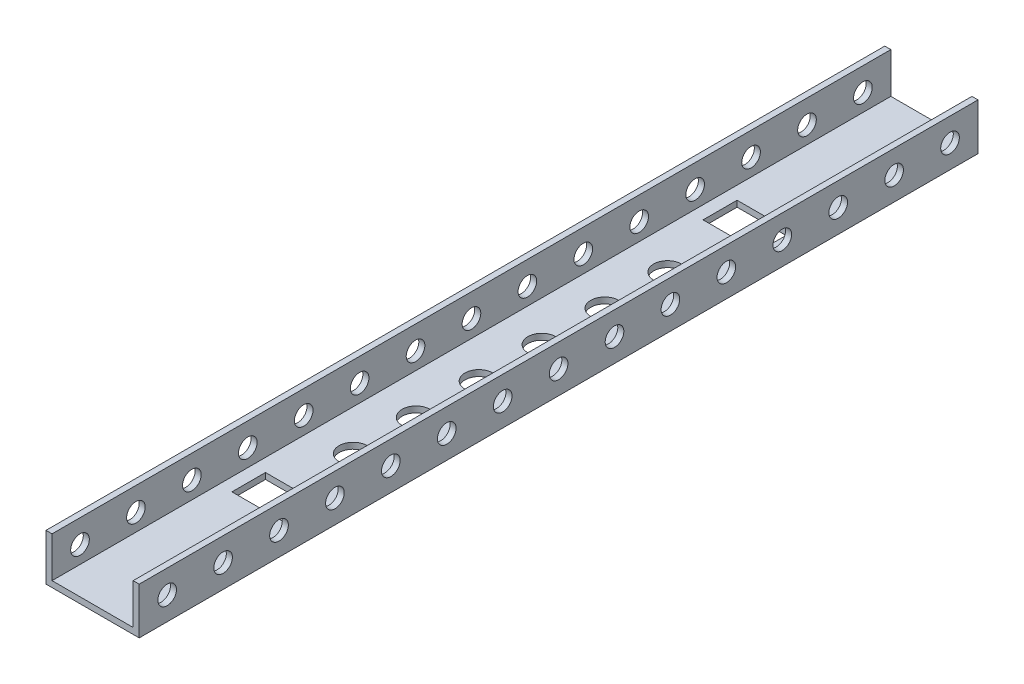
ISO-10303-21;
HEADER;
FILE_DESCRIPTION(('STEP AP214'),'2;1');
FILE_NAME('part.step','',(''),(''),'','','');
FILE_SCHEMA(('AUTOMOTIVE_DESIGN { 1 0 10303 214 1 1 1 1 }'));
ENDSEC;
DATA;
#1=APPLICATION_CONTEXT('core data for automotive mechanical design processes');
#2=APPLICATION_PROTOCOL_DEFINITION('international standard','automotive_design',2000,#1);
#3=PRODUCT_CONTEXT('',#1,'mechanical');
#4=PRODUCT('Part','Part','',(#3));
#5=PRODUCT_RELATED_PRODUCT_CATEGORY('part','',(#4));
#6=PRODUCT_DEFINITION_FORMATION('','',#4);
#7=PRODUCT_DEFINITION_CONTEXT('part definition',#1,'design');
#8=PRODUCT_DEFINITION('design','',#6,#7);
#9=PRODUCT_DEFINITION_SHAPE('','',#8);
#10=(LENGTH_UNIT() NAMED_UNIT(*) SI_UNIT(.MILLI.,.METRE.));
#11=(NAMED_UNIT(*) PLANE_ANGLE_UNIT() SI_UNIT($,.RADIAN.));
#12=(NAMED_UNIT(*) SI_UNIT($,.STERADIAN.) SOLID_ANGLE_UNIT());
#13=UNCERTAINTY_MEASURE_WITH_UNIT(LENGTH_MEASURE(1.E-05),#10,'distance_accuracy_value','');
#14=(GEOMETRIC_REPRESENTATION_CONTEXT(3) GLOBAL_UNCERTAINTY_ASSIGNED_CONTEXT((#13)) GLOBAL_UNIT_ASSIGNED_CONTEXT((#10,
#11,#12)) REPRESENTATION_CONTEXT('',''));
#15=CARTESIAN_POINT('',(0.,0.,0.));
#16=DIRECTION('',(0.,0.,1.));
#17=DIRECTION('',(1.,0.,0.));
#18=AXIS2_PLACEMENT_3D('',#15,#16,#17);
#19=CARTESIAN_POINT('',(-22.9308176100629,-18.1106918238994,457.2));
#20=DIRECTION('',(0.,1.,0.));
#21=DIRECTION('',(0.,0.,1.));
#22=AXIS2_PLACEMENT_3D('',#19,#20,#21);
#23=PLANE('',#22);
#24=CARTESIAN_POINT('',(2.46918238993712,-18.1106918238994,315.214));
#25=DIRECTION('',(0.,1.,0.));
#26=DIRECTION('',(0.,0.,1.));
#27=AXIS2_PLACEMENT_3D('',#24,#25,#26);
#28=CIRCLE('',#27,7.62000000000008);
#29=CARTESIAN_POINT('',(2.46918238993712,-18.1106918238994,322.834));
#30=VERTEX_POINT('',#29);
#31=EDGE_CURVE('E680',#30,#30,#28,.T.);
#32=ORIENTED_EDGE('',*,*,#31,.T.);
#33=EDGE_LOOP('',(#32));
#34=FACE_BOUND('',#33,.T.);
#35=CARTESIAN_POINT('',(2.46918238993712,-18.1106918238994,280.924));
#36=DIRECTION('',(0.,1.,0.));
#37=DIRECTION('',(0.,0.,1.));
#38=AXIS2_PLACEMENT_3D('',#35,#36,#37);
#39=CIRCLE('',#38,7.62000000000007);
#40=CARTESIAN_POINT('',(2.46918238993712,-18.1106918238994,288.544));
#41=VERTEX_POINT('',#40);
#42=EDGE_CURVE('E684',#41,#41,#39,.T.);
#43=ORIENTED_EDGE('',*,*,#42,.T.);
#44=EDGE_LOOP('',(#43));
#45=FACE_BOUND('',#44,.T.);
#46=CARTESIAN_POINT('',(2.46918238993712,-18.1106918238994,246.634));
#47=DIRECTION('',(0.,1.,0.));
#48=DIRECTION('',(0.,0.,1.));
#49=AXIS2_PLACEMENT_3D('',#46,#47,#48);
#50=CIRCLE('',#49,7.62000000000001);
#51=CARTESIAN_POINT('',(2.46918238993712,-18.1106918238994,254.254));
#52=VERTEX_POINT('',#51);
#53=EDGE_CURVE('E693',#52,#52,#50,.T.);
#54=ORIENTED_EDGE('',*,*,#53,.T.);
#55=EDGE_LOOP('',(#54));
#56=FACE_BOUND('',#55,.T.);
#57=CARTESIAN_POINT('',(2.46918238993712,-18.1106918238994,212.344));
#58=DIRECTION('',(0.,1.,0.));
#59=DIRECTION('',(0.,0.,1.));
#60=AXIS2_PLACEMENT_3D('',#57,#58,#59);
#61=CIRCLE('',#60,7.62);
#62=CARTESIAN_POINT('',(2.46918238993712,-18.1106918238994,219.964));
#63=VERTEX_POINT('',#62);
#64=EDGE_CURVE('E699',#63,#63,#61,.T.);
#65=ORIENTED_EDGE('',*,*,#64,.T.);
#66=EDGE_LOOP('',(#65));
#67=FACE_BOUND('',#66,.T.);
#68=CARTESIAN_POINT('',(2.46918238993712,-18.1106918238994,178.054));
#69=DIRECTION('',(0.,1.,0.));
#70=DIRECTION('',(0.,0.,1.));
#71=AXIS2_PLACEMENT_3D('',#68,#69,#70);
#72=CIRCLE('',#71,7.62);
#73=CARTESIAN_POINT('',(2.46918238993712,-18.1106918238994,185.674));
#74=VERTEX_POINT('',#73);
#75=EDGE_CURVE('E705',#74,#74,#72,.T.);
#76=ORIENTED_EDGE('',*,*,#75,.T.);
#77=EDGE_LOOP('',(#76));
#78=FACE_BOUND('',#77,.T.);
#79=CARTESIAN_POINT('',(2.46918238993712,-18.1106918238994,143.764));
#80=DIRECTION('',(0.,1.,0.));
#81=DIRECTION('',(0.,0.,1.));
#82=AXIS2_PLACEMENT_3D('',#79,#80,#81);
#83=CIRCLE('',#82,7.62);
#84=CARTESIAN_POINT('',(2.46918238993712,-18.1106918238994,151.384));
#85=VERTEX_POINT('',#84);
#86=EDGE_CURVE('E711',#85,#85,#83,.T.);
#87=ORIENTED_EDGE('',*,*,#86,.T.);
#88=EDGE_LOOP('',(#87));
#89=FACE_BOUND('',#88,.T.);
#90=DIRECTION('',(-1.,0.,0.));
#91=VECTOR('',#90,1.);
#92=CARTESIAN_POINT('',(-22.9308176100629,-18.1106918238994,347.98));
#93=LINE('',#92,#91);
#94=CARTESIAN_POINT('',(17.4551823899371,-18.1106918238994,347.98));
#95=VERTEX_POINT('',#94);
#96=CARTESIAN_POINT('',(-12.5168176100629,-18.1106918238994,347.98));
#97=VERTEX_POINT('',#96);
#98=EDGE_CURVE('E177',#95,#97,#93,.T.);
#99=ORIENTED_EDGE('',*,*,#98,.T.);
#100=DIRECTION('',(0.,0.,1.));
#101=VECTOR('',#100,1.);
#102=CARTESIAN_POINT('',(-12.5168176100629,-18.1106918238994,457.2));
#103=LINE('',#102,#101);
#104=CARTESIAN_POINT('',(-12.5168176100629,-18.1106918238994,366.268));
#105=VERTEX_POINT('',#104);
#106=EDGE_CURVE('E180',#97,#105,#103,.T.);
#107=ORIENTED_EDGE('',*,*,#106,.T.);
#108=DIRECTION('',(1.,0.,0.));
#109=VECTOR('',#108,1.);
#110=CARTESIAN_POINT('',(-22.9308176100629,-18.1106918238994,366.268));
#111=LINE('',#110,#109);
#112=CARTESIAN_POINT('',(17.4551823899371,-18.1106918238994,366.268));
#113=VERTEX_POINT('',#112);
#114=EDGE_CURVE('E172',#105,#113,#111,.T.);
#115=ORIENTED_EDGE('',*,*,#114,.T.);
#116=DIRECTION('',(0.,0.,-1.));
#117=VECTOR('',#116,1.);
#118=CARTESIAN_POINT('',(17.4551823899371,-18.1106918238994,457.2));
#119=LINE('',#118,#117);
#120=EDGE_CURVE('E152',#113,#95,#119,.T.);
#121=ORIENTED_EDGE('',*,*,#120,.T.);
#122=EDGE_LOOP('',(#99,#107,#115,#121));
#123=FACE_BOUND('',#122,.T.);
#124=DIRECTION('',(-1.,0.,0.));
#125=VECTOR('',#124,1.);
#126=CARTESIAN_POINT('',(-22.9308176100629,-18.1106918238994,90.932));
#127=LINE('',#126,#125);
#128=CARTESIAN_POINT('',(17.4551823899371,-18.1106918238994,90.932));
#129=VERTEX_POINT('',#128);
#130=CARTESIAN_POINT('',(-12.5168176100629,-18.1106918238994,90.932));
#131=VERTEX_POINT('',#130);
#132=EDGE_CURVE('E209',#129,#131,#127,.T.);
#133=ORIENTED_EDGE('',*,*,#132,.T.);
#134=DIRECTION('',(0.,0.,1.));
#135=VECTOR('',#134,1.);
#136=CARTESIAN_POINT('',(-12.5168176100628,-18.1106918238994,457.2));
#137=LINE('',#136,#135);
#138=CARTESIAN_POINT('',(-12.5168176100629,-18.1106918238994,109.474));
#139=VERTEX_POINT('',#138);
#140=EDGE_CURVE('E212',#131,#139,#137,.T.);
#141=ORIENTED_EDGE('',*,*,#140,.T.);
#142=DIRECTION('',(1.,0.,0.));
#143=VECTOR('',#142,1.);
#144=CARTESIAN_POINT('',(-22.9308176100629,-18.1106918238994,109.474));
#145=LINE('',#144,#143);
#146=CARTESIAN_POINT('',(17.4551823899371,-18.1106918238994,109.474));
#147=VERTEX_POINT('',#146);
#148=EDGE_CURVE('E197',#139,#147,#145,.T.);
#149=ORIENTED_EDGE('',*,*,#148,.T.);
#150=DIRECTION('',(0.,0.,-1.));
#151=VECTOR('',#150,1.);
#152=CARTESIAN_POINT('',(17.4551823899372,-18.1106918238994,457.2));
#153=LINE('',#152,#151);
#154=EDGE_CURVE('E206',#147,#129,#153,.T.);
#155=ORIENTED_EDGE('',*,*,#154,.T.);
#156=EDGE_LOOP('',(#133,#141,#149,#155));
#157=FACE_BOUND('',#156,.T.);
#158=DIRECTION('',(1.,0.,0.));
#159=VECTOR('',#158,1.);
#160=CARTESIAN_POINT('',(-22.9308176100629,-18.1106918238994,0.));
#161=LINE('',#160,#159);
#162=CARTESIAN_POINT('',(-22.9308176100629,-18.1106918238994,0.));
#163=VERTEX_POINT('',#162);
#164=CARTESIAN_POINT('',(27.8691823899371,-18.1106918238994,0.));
#165=VERTEX_POINT('',#164);
#166=EDGE_CURVE('E364',#163,#165,#161,.T.);
#167=ORIENTED_EDGE('',*,*,#166,.T.);
#168=DIRECTION('',(0.,0.,-1.));
#169=VECTOR('',#168,1.);
#170=CARTESIAN_POINT('',(27.8691823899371,-18.1106918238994,457.2));
#171=LINE('',#170,#169);
#172=CARTESIAN_POINT('',(27.8691823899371,-18.1106918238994,457.2));
#173=VERTEX_POINT('',#172);
#174=EDGE_CURVE('E11',#173,#165,#171,.T.);
#175=ORIENTED_EDGE('',*,*,#174,.F.);
#176=DIRECTION('',(1.,0.,0.));
#177=VECTOR('',#176,1.);
#178=CARTESIAN_POINT('',(-22.9308176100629,-18.1106918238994,457.2));
#179=LINE('',#178,#177);
#180=CARTESIAN_POINT('',(-22.9308176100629,-18.1106918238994,457.2));
#181=VERTEX_POINT('',#180);
#182=EDGE_CURVE('E365',#181,#173,#179,.T.);
#183=ORIENTED_EDGE('',*,*,#182,.F.);
#184=DIRECTION('',(0.,0.,-1.));
#185=VECTOR('',#184,1.);
#186=CARTESIAN_POINT('',(-22.9308176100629,-18.1106918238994,457.2));
#187=LINE('',#186,#185);
#188=EDGE_CURVE('E383',#181,#163,#187,.T.);
#189=ORIENTED_EDGE('',*,*,#188,.T.);
#190=EDGE_LOOP('',(#167,#175,#183,#189));
#191=FACE_BOUND('',#190,.T.);
#192=ADVANCED_FACE('F32',(#34,#45,#56,#67,#78,#89,#123,#157,#191),#23,.F.);
#193=CARTESIAN_POINT('',(27.8691823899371,-18.1106918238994,457.2));
#194=DIRECTION('',(-1.,0.,0.));
#195=DIRECTION('',(0.,0.,1.));
#196=AXIS2_PLACEMENT_3D('',#193,#194,#195);
#197=PLANE('',#196);
#198=CARTESIAN_POINT('',(27.8691823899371,-5.41069182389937,15.24));
#199=DIRECTION('',(1.,0.,0.));
#200=DIRECTION('',(0.,0.,-1.));
#201=AXIS2_PLACEMENT_3D('',#198,#199,#200);
#202=CIRCLE('',#201,5.08);
#203=CARTESIAN_POINT('',(27.8691823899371,-5.41069182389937,10.16));
#204=VERTEX_POINT('',#203);
#205=EDGE_CURVE('E215',#204,#204,#202,.T.);
#206=ORIENTED_EDGE('',*,*,#205,.F.);
#207=EDGE_LOOP('',(#206));
#208=FACE_BOUND('',#207,.T.);
#209=CARTESIAN_POINT('',(27.8691823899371,-5.41069182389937,441.96));
#210=DIRECTION('',(1.,0.,0.));
#211=DIRECTION('',(0.,0.,-1.));
#212=AXIS2_PLACEMENT_3D('',#209,#210,#211);
#213=CIRCLE('',#212,5.07999999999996);
#214=CARTESIAN_POINT('',(27.8691823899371,-5.41069182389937,436.88));
#215=VERTEX_POINT('',#214);
#216=EDGE_CURVE('E224',#215,#215,#213,.T.);
#217=ORIENTED_EDGE('',*,*,#216,.F.);
#218=EDGE_LOOP('',(#217));
#219=FACE_BOUND('',#218,.T.);
#220=CARTESIAN_POINT('',(27.8691823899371,-5.41069182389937,45.72));
#221=DIRECTION('',(1.,0.,0.));
#222=DIRECTION('',(0.,0.,-1.));
#223=AXIS2_PLACEMENT_3D('',#220,#221,#222);
#224=CIRCLE('',#223,5.08);
#225=CARTESIAN_POINT('',(27.8691823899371,-5.41069182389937,40.64));
#226=VERTEX_POINT('',#225);
#227=EDGE_CURVE('E234',#226,#226,#224,.T.);
#228=ORIENTED_EDGE('',*,*,#227,.F.);
#229=EDGE_LOOP('',(#228));
#230=FACE_BOUND('',#229,.T.);
#231=CARTESIAN_POINT('',(27.8691823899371,-5.41069182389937,76.2));
#232=DIRECTION('',(1.,0.,0.));
#233=DIRECTION('',(0.,0.,-1.));
#234=AXIS2_PLACEMENT_3D('',#231,#232,#233);
#235=CIRCLE('',#234,5.08);
#236=CARTESIAN_POINT('',(27.8691823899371,-5.41069182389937,71.12));
#237=VERTEX_POINT('',#236);
#238=EDGE_CURVE('E244',#237,#237,#235,.T.);
#239=ORIENTED_EDGE('',*,*,#238,.F.);
#240=EDGE_LOOP('',(#239));
#241=FACE_BOUND('',#240,.T.);
#242=CARTESIAN_POINT('',(27.8691823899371,-5.41069182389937,106.68));
#243=DIRECTION('',(1.,0.,0.));
#244=DIRECTION('',(0.,0.,-1.));
#245=AXIS2_PLACEMENT_3D('',#242,#243,#244);
#246=CIRCLE('',#245,5.08);
#247=CARTESIAN_POINT('',(27.8691823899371,-5.41069182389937,101.6));
#248=VERTEX_POINT('',#247);
#249=EDGE_CURVE('E254',#248,#248,#246,.T.);
#250=ORIENTED_EDGE('',*,*,#249,.F.);
#251=EDGE_LOOP('',(#250));
#252=FACE_BOUND('',#251,.T.);
#253=CARTESIAN_POINT('',(27.8691823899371,-5.41069182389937,137.16));
#254=DIRECTION('',(1.,0.,0.));
#255=DIRECTION('',(0.,0.,-1.));
#256=AXIS2_PLACEMENT_3D('',#253,#254,#255);
#257=CIRCLE('',#256,5.07999999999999);
#258=CARTESIAN_POINT('',(27.8691823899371,-5.41069182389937,132.08));
#259=VERTEX_POINT('',#258);
#260=EDGE_CURVE('E264',#259,#259,#257,.T.);
#261=ORIENTED_EDGE('',*,*,#260,.F.);
#262=EDGE_LOOP('',(#261));
#263=FACE_BOUND('',#262,.T.);
#264=CARTESIAN_POINT('',(27.8691823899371,-5.41069182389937,167.64));
#265=DIRECTION('',(1.,0.,0.));
#266=DIRECTION('',(0.,0.,-1.));
#267=AXIS2_PLACEMENT_3D('',#264,#265,#266);
#268=CIRCLE('',#267,5.07999999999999);
#269=CARTESIAN_POINT('',(27.8691823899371,-5.41069182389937,162.56));
#270=VERTEX_POINT('',#269);
#271=EDGE_CURVE('E274',#270,#270,#268,.T.);
#272=ORIENTED_EDGE('',*,*,#271,.F.);
#273=EDGE_LOOP('',(#272));
#274=FACE_BOUND('',#273,.T.);
#275=CARTESIAN_POINT('',(27.8691823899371,-5.41069182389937,198.12));
#276=DIRECTION('',(1.,0.,0.));
#277=DIRECTION('',(0.,0.,-1.));
#278=AXIS2_PLACEMENT_3D('',#275,#276,#277);
#279=CIRCLE('',#278,5.07999999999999);
#280=CARTESIAN_POINT('',(27.8691823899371,-5.41069182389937,193.04));
#281=VERTEX_POINT('',#280);
#282=EDGE_CURVE('E284',#281,#281,#279,.T.);
#283=ORIENTED_EDGE('',*,*,#282,.F.);
#284=EDGE_LOOP('',(#283));
#285=FACE_BOUND('',#284,.T.);
#286=CARTESIAN_POINT('',(27.8691823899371,-5.41069182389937,411.48));
#287=DIRECTION('',(1.,0.,0.));
#288=DIRECTION('',(0.,0.,-1.));
#289=AXIS2_PLACEMENT_3D('',#286,#287,#288);
#290=CIRCLE('',#289,5.07999999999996);
#291=CARTESIAN_POINT('',(27.8691823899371,-5.41069182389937,406.4));
#292=VERTEX_POINT('',#291);
#293=EDGE_CURVE('E294',#292,#292,#290,.T.);
#294=ORIENTED_EDGE('',*,*,#293,.F.);
#295=EDGE_LOOP('',(#294));
#296=FACE_BOUND('',#295,.T.);
#297=CARTESIAN_POINT('',(27.8691823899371,-5.41069182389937,381.));
#298=DIRECTION('',(1.,0.,0.));
#299=DIRECTION('',(0.,0.,-1.));
#300=AXIS2_PLACEMENT_3D('',#297,#298,#299);
#301=CIRCLE('',#300,5.07999999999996);
#302=CARTESIAN_POINT('',(27.8691823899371,-5.41069182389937,375.92));
#303=VERTEX_POINT('',#302);
#304=EDGE_CURVE('E304',#303,#303,#301,.T.);
#305=ORIENTED_EDGE('',*,*,#304,.F.);
#306=EDGE_LOOP('',(#305));
#307=FACE_BOUND('',#306,.T.);
#308=CARTESIAN_POINT('',(27.8691823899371,-5.41069182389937,350.52));
#309=DIRECTION('',(1.,0.,0.));
#310=DIRECTION('',(0.,0.,-1.));
#311=AXIS2_PLACEMENT_3D('',#308,#309,#310);
#312=CIRCLE('',#311,5.07999999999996);
#313=CARTESIAN_POINT('',(27.8691823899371,-5.41069182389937,345.44));
#314=VERTEX_POINT('',#313);
#315=EDGE_CURVE('E314',#314,#314,#312,.T.);
#316=ORIENTED_EDGE('',*,*,#315,.F.);
#317=EDGE_LOOP('',(#316));
#318=FACE_BOUND('',#317,.T.);
#319=CARTESIAN_POINT('',(27.8691823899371,-5.41069182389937,320.04));
#320=DIRECTION('',(1.,0.,0.));
#321=DIRECTION('',(0.,0.,-1.));
#322=AXIS2_PLACEMENT_3D('',#319,#320,#321);
#323=CIRCLE('',#322,5.07999999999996);
#324=CARTESIAN_POINT('',(27.8691823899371,-5.41069182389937,314.96));
#325=VERTEX_POINT('',#324);
#326=EDGE_CURVE('E324',#325,#325,#323,.T.);
#327=ORIENTED_EDGE('',*,*,#326,.F.);
#328=EDGE_LOOP('',(#327));
#329=FACE_BOUND('',#328,.T.);
#330=CARTESIAN_POINT('',(27.8691823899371,-5.41069182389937,289.56));
#331=DIRECTION('',(1.,0.,0.));
#332=DIRECTION('',(0.,0.,-1.));
#333=AXIS2_PLACEMENT_3D('',#330,#331,#332);
#334=CIRCLE('',#333,5.07999999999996);
#335=CARTESIAN_POINT('',(27.8691823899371,-5.41069182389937,284.48));
#336=VERTEX_POINT('',#335);
#337=EDGE_CURVE('E334',#336,#336,#334,.T.);
#338=ORIENTED_EDGE('',*,*,#337,.F.);
#339=EDGE_LOOP('',(#338));
#340=FACE_BOUND('',#339,.T.);
#341=CARTESIAN_POINT('',(27.8691823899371,-5.41069182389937,259.08));
#342=DIRECTION('',(1.,0.,0.));
#343=DIRECTION('',(0.,0.,-1.));
#344=AXIS2_PLACEMENT_3D('',#341,#342,#343);
#345=CIRCLE('',#344,5.07999999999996);
#346=CARTESIAN_POINT('',(27.8691823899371,-5.41069182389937,254.));
#347=VERTEX_POINT('',#346);
#348=EDGE_CURVE('E344',#347,#347,#345,.T.);
#349=ORIENTED_EDGE('',*,*,#348,.F.);
#350=EDGE_LOOP('',(#349));
#351=FACE_BOUND('',#350,.T.);
#352=CARTESIAN_POINT('',(27.8691823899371,-5.41069182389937,228.6));
#353=DIRECTION('',(1.,0.,0.));
#354=DIRECTION('',(0.,0.,-1.));
#355=AXIS2_PLACEMENT_3D('',#352,#353,#354);
#356=CIRCLE('',#355,5.07999999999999);
#357=CARTESIAN_POINT('',(27.8691823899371,-5.41069182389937,223.52));
#358=VERTEX_POINT('',#357);
#359=EDGE_CURVE('E354',#358,#358,#356,.T.);
#360=ORIENTED_EDGE('',*,*,#359,.F.);
#361=EDGE_LOOP('',(#360));
#362=FACE_BOUND('',#361,.T.);
#363=DIRECTION('',(0.,1.,0.));
#364=VECTOR('',#363,1.);
#365=CARTESIAN_POINT('',(27.8691823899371,-18.1106918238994,0.));
#366=LINE('',#365,#364);
#367=CARTESIAN_POINT('',(27.8691823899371,7.28930817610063,0.));
#368=VERTEX_POINT('',#367);
#369=EDGE_CURVE('E386',#165,#368,#366,.T.);
#370=ORIENTED_EDGE('',*,*,#369,.T.);
#371=DIRECTION('',(0.,0.,-1.));
#372=VECTOR('',#371,1.);
#373=CARTESIAN_POINT('',(27.8691823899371,7.28930817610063,457.2));
#374=LINE('',#373,#372);
#375=CARTESIAN_POINT('',(27.8691823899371,7.28930817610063,457.2));
#376=VERTEX_POINT('',#375);
#377=EDGE_CURVE('E40',#376,#368,#374,.T.);
#378=ORIENTED_EDGE('',*,*,#377,.F.);
#379=DIRECTION('',(0.,1.,0.));
#380=VECTOR('',#379,1.);
#381=CARTESIAN_POINT('',(27.8691823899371,-18.1106918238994,457.2));
#382=LINE('',#381,#380);
#383=EDGE_CURVE('E368',#173,#376,#382,.T.);
#384=ORIENTED_EDGE('',*,*,#383,.F.);
#385=ORIENTED_EDGE('',*,*,#174,.T.);
#386=EDGE_LOOP('',(#370,#378,#384,#385));
#387=FACE_BOUND('',#386,.T.);
#388=ADVANCED_FACE('F524',(#208,#219,#230,#241,#252,#263,#274,#285,#296,#307,#318,#329,#340,
#351,#362,#387),#197,.F.);
#389=CARTESIAN_POINT('',(27.8691823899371,7.28930817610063,457.2));
#390=DIRECTION('',(0.,-1.,0.));
#391=DIRECTION('',(0.,0.,-1.));
#392=AXIS2_PLACEMENT_3D('',#389,#390,#391);
#393=PLANE('',#392);
#394=DIRECTION('',(-1.,0.,0.));
#395=VECTOR('',#394,1.);
#396=CARTESIAN_POINT('',(27.8691823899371,7.28930817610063,0.));
#397=LINE('',#396,#395);
#398=CARTESIAN_POINT('',(24.5671823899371,7.28930817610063,0.));
#399=VERTEX_POINT('',#398);
#400=EDGE_CURVE('E388',#368,#399,#397,.T.);
#401=ORIENTED_EDGE('',*,*,#400,.T.);
#402=DIRECTION('',(0.,0.,-1.));
#403=VECTOR('',#402,1.);
#404=CARTESIAN_POINT('',(24.5671823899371,7.28930817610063,457.2));
#405=LINE('',#404,#403);
#406=CARTESIAN_POINT('',(24.5671823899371,7.28930817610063,457.2));
#407=VERTEX_POINT('',#406);
#408=EDGE_CURVE('E413',#407,#399,#405,.T.);
#409=ORIENTED_EDGE('',*,*,#408,.F.);
#410=DIRECTION('',(-1.,0.,0.));
#411=VECTOR('',#410,1.);
#412=CARTESIAN_POINT('',(27.8691823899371,7.28930817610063,457.2));
#413=LINE('',#412,#411);
#414=EDGE_CURVE('E371',#376,#407,#413,.T.);
#415=ORIENTED_EDGE('',*,*,#414,.F.);
#416=ORIENTED_EDGE('',*,*,#377,.T.);
#417=EDGE_LOOP('',(#401,#409,#415,#416));
#418=FACE_BOUND('',#417,.T.);
#419=ADVANCED_FACE('F522',(#418),#393,.F.);
#420=CARTESIAN_POINT('',(24.5671823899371,7.28930817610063,457.2));
#421=DIRECTION('',(1.,0.,0.));
#422=DIRECTION('',(0.,1.,0.));
#423=AXIS2_PLACEMENT_3D('',#420,#421,#422);
#424=PLANE('',#423);
#425=CARTESIAN_POINT('',(24.5671823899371,-5.41069182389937,15.24));
#426=DIRECTION('',(1.,0.,0.));
#427=DIRECTION('',(0.,1.,0.));
#428=AXIS2_PLACEMENT_3D('',#425,#426,#427);
#429=CIRCLE('',#428,5.08);
#430=CARTESIAN_POINT('',(24.5671823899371,-0.33069182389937,15.24));
#431=VERTEX_POINT('',#430);
#432=EDGE_CURVE('E221',#431,#431,#429,.T.);
#433=ORIENTED_EDGE('',*,*,#432,.T.);
#434=EDGE_LOOP('',(#433));
#435=FACE_BOUND('',#434,.T.);
#436=CARTESIAN_POINT('',(24.5671823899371,-5.41069182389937,441.96));
#437=DIRECTION('',(1.,0.,0.));
#438=DIRECTION('',(0.,1.,0.));
#439=AXIS2_PLACEMENT_3D('',#436,#437,#438);
#440=CIRCLE('',#439,5.07999999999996);
#441=CARTESIAN_POINT('',(24.5671823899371,-0.330691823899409,441.96));
#442=VERTEX_POINT('',#441);
#443=EDGE_CURVE('E231',#442,#442,#440,.T.);
#444=ORIENTED_EDGE('',*,*,#443,.T.);
#445=EDGE_LOOP('',(#444));
#446=FACE_BOUND('',#445,.T.);
#447=CARTESIAN_POINT('',(24.5671823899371,-5.41069182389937,45.72));
#448=DIRECTION('',(1.,0.,0.));
#449=DIRECTION('',(0.,1.,0.));
#450=AXIS2_PLACEMENT_3D('',#447,#448,#449);
#451=CIRCLE('',#450,5.08);
#452=CARTESIAN_POINT('',(24.5671823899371,-0.330691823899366,45.72));
#453=VERTEX_POINT('',#452);
#454=EDGE_CURVE('E241',#453,#453,#451,.T.);
#455=ORIENTED_EDGE('',*,*,#454,.T.);
#456=EDGE_LOOP('',(#455));
#457=FACE_BOUND('',#456,.T.);
#458=CARTESIAN_POINT('',(24.5671823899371,-5.41069182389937,76.2));
#459=DIRECTION('',(1.,0.,0.));
#460=DIRECTION('',(0.,1.,0.));
#461=AXIS2_PLACEMENT_3D('',#458,#459,#460);
#462=CIRCLE('',#461,5.08);
#463=CARTESIAN_POINT('',(24.5671823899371,-0.330691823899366,76.2));
#464=VERTEX_POINT('',#463);
#465=EDGE_CURVE('E251',#464,#464,#462,.T.);
#466=ORIENTED_EDGE('',*,*,#465,.T.);
#467=EDGE_LOOP('',(#466));
#468=FACE_BOUND('',#467,.T.);
#469=CARTESIAN_POINT('',(24.5671823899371,-5.41069182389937,106.68));
#470=DIRECTION('',(1.,0.,0.));
#471=DIRECTION('',(0.,1.,0.));
#472=AXIS2_PLACEMENT_3D('',#469,#470,#471);
#473=CIRCLE('',#472,5.08);
#474=CARTESIAN_POINT('',(24.5671823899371,-0.330691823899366,106.68));
#475=VERTEX_POINT('',#474);
#476=EDGE_CURVE('E261',#475,#475,#473,.T.);
#477=ORIENTED_EDGE('',*,*,#476,.T.);
#478=EDGE_LOOP('',(#477));
#479=FACE_BOUND('',#478,.T.);
#480=CARTESIAN_POINT('',(24.5671823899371,-5.41069182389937,137.16));
#481=DIRECTION('',(1.,0.,0.));
#482=DIRECTION('',(0.,1.,0.));
#483=AXIS2_PLACEMENT_3D('',#480,#481,#482);
#484=CIRCLE('',#483,5.07999999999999);
#485=CARTESIAN_POINT('',(24.5671823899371,-0.330691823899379,137.16));
#486=VERTEX_POINT('',#485);
#487=EDGE_CURVE('E271',#486,#486,#484,.T.);
#488=ORIENTED_EDGE('',*,*,#487,.T.);
#489=EDGE_LOOP('',(#488));
#490=FACE_BOUND('',#489,.T.);
#491=CARTESIAN_POINT('',(24.5671823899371,-5.41069182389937,167.64));
#492=DIRECTION('',(1.,0.,0.));
#493=DIRECTION('',(0.,1.,0.));
#494=AXIS2_PLACEMENT_3D('',#491,#492,#493);
#495=CIRCLE('',#494,5.07999999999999);
#496=CARTESIAN_POINT('',(24.5671823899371,-0.330691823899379,167.64));
#497=VERTEX_POINT('',#496);
#498=EDGE_CURVE('E281',#497,#497,#495,.T.);
#499=ORIENTED_EDGE('',*,*,#498,.T.);
#500=EDGE_LOOP('',(#499));
#501=FACE_BOUND('',#500,.T.);
#502=CARTESIAN_POINT('',(24.5671823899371,-5.41069182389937,198.12));
#503=DIRECTION('',(1.,0.,0.));
#504=DIRECTION('',(0.,1.,0.));
#505=AXIS2_PLACEMENT_3D('',#502,#503,#504);
#506=CIRCLE('',#505,5.07999999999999);
#507=CARTESIAN_POINT('',(24.5671823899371,-0.330691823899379,198.12));
#508=VERTEX_POINT('',#507);
#509=EDGE_CURVE('E291',#508,#508,#506,.T.);
#510=ORIENTED_EDGE('',*,*,#509,.T.);
#511=EDGE_LOOP('',(#510));
#512=FACE_BOUND('',#511,.T.);
#513=CARTESIAN_POINT('',(24.5671823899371,-5.41069182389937,411.48));
#514=DIRECTION('',(1.,0.,0.));
#515=DIRECTION('',(0.,1.,0.));
#516=AXIS2_PLACEMENT_3D('',#513,#514,#515);
#517=CIRCLE('',#516,5.07999999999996);
#518=CARTESIAN_POINT('',(24.5671823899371,-0.330691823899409,411.48));
#519=VERTEX_POINT('',#518);
#520=EDGE_CURVE('E301',#519,#519,#517,.T.);
#521=ORIENTED_EDGE('',*,*,#520,.T.);
#522=EDGE_LOOP('',(#521));
#523=FACE_BOUND('',#522,.T.);
#524=CARTESIAN_POINT('',(24.5671823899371,-5.41069182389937,381.));
#525=DIRECTION('',(1.,0.,0.));
#526=DIRECTION('',(0.,1.,0.));
#527=AXIS2_PLACEMENT_3D('',#524,#525,#526);
#528=CIRCLE('',#527,5.07999999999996);
#529=CARTESIAN_POINT('',(24.5671823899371,-0.330691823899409,381.));
#530=VERTEX_POINT('',#529);
#531=EDGE_CURVE('E311',#530,#530,#528,.T.);
#532=ORIENTED_EDGE('',*,*,#531,.T.);
#533=EDGE_LOOP('',(#532));
#534=FACE_BOUND('',#533,.T.);
#535=CARTESIAN_POINT('',(24.5671823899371,-5.41069182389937,350.52));
#536=DIRECTION('',(1.,0.,0.));
#537=DIRECTION('',(0.,1.,0.));
#538=AXIS2_PLACEMENT_3D('',#535,#536,#537);
#539=CIRCLE('',#538,5.07999999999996);
#540=CARTESIAN_POINT('',(24.5671823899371,-0.330691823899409,350.52));
#541=VERTEX_POINT('',#540);
#542=EDGE_CURVE('E321',#541,#541,#539,.T.);
#543=ORIENTED_EDGE('',*,*,#542,.T.);
#544=EDGE_LOOP('',(#543));
#545=FACE_BOUND('',#544,.T.);
#546=CARTESIAN_POINT('',(24.5671823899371,-5.41069182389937,320.04));
#547=DIRECTION('',(1.,0.,0.));
#548=DIRECTION('',(0.,1.,0.));
#549=AXIS2_PLACEMENT_3D('',#546,#547,#548);
#550=CIRCLE('',#549,5.07999999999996);
#551=CARTESIAN_POINT('',(24.5671823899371,-0.330691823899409,320.04));
#552=VERTEX_POINT('',#551);
#553=EDGE_CURVE('E331',#552,#552,#550,.T.);
#554=ORIENTED_EDGE('',*,*,#553,.T.);
#555=EDGE_LOOP('',(#554));
#556=FACE_BOUND('',#555,.T.);
#557=CARTESIAN_POINT('',(24.5671823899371,-5.41069182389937,289.56));
#558=DIRECTION('',(1.,0.,0.));
#559=DIRECTION('',(0.,1.,0.));
#560=AXIS2_PLACEMENT_3D('',#557,#558,#559);
#561=CIRCLE('',#560,5.07999999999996);
#562=CARTESIAN_POINT('',(24.5671823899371,-0.330691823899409,289.56));
#563=VERTEX_POINT('',#562);
#564=EDGE_CURVE('E341',#563,#563,#561,.T.);
#565=ORIENTED_EDGE('',*,*,#564,.T.);
#566=EDGE_LOOP('',(#565));
#567=FACE_BOUND('',#566,.T.);
#568=CARTESIAN_POINT('',(24.5671823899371,-5.41069182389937,259.08));
#569=DIRECTION('',(1.,0.,0.));
#570=DIRECTION('',(0.,1.,0.));
#571=AXIS2_PLACEMENT_3D('',#568,#569,#570);
#572=CIRCLE('',#571,5.07999999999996);
#573=CARTESIAN_POINT('',(24.5671823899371,-0.330691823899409,259.08));
#574=VERTEX_POINT('',#573);
#575=EDGE_CURVE('E351',#574,#574,#572,.T.);
#576=ORIENTED_EDGE('',*,*,#575,.T.);
#577=EDGE_LOOP('',(#576));
#578=FACE_BOUND('',#577,.T.);
#579=CARTESIAN_POINT('',(24.5671823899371,-5.41069182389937,228.6));
#580=DIRECTION('',(1.,0.,0.));
#581=DIRECTION('',(0.,1.,0.));
#582=AXIS2_PLACEMENT_3D('',#579,#580,#581);
#583=CIRCLE('',#582,5.07999999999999);
#584=CARTESIAN_POINT('',(24.5671823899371,-0.330691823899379,228.6));
#585=VERTEX_POINT('',#584);
#586=EDGE_CURVE('E361',#585,#585,#583,.T.);
#587=ORIENTED_EDGE('',*,*,#586,.T.);
#588=EDGE_LOOP('',(#587));
#589=FACE_BOUND('',#588,.T.);
#590=DIRECTION('',(0.,-1.,0.));
#591=VECTOR('',#590,1.);
#592=CARTESIAN_POINT('',(24.5671823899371,7.28930817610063,0.));
#593=LINE('',#592,#591);
#594=CARTESIAN_POINT('',(24.5671823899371,-14.8086918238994,0.));
#595=VERTEX_POINT('',#594);
#596=EDGE_CURVE('E390',#399,#595,#593,.T.);
#597=ORIENTED_EDGE('',*,*,#596,.T.);
#598=DIRECTION('',(0.,0.,-1.));
#599=VECTOR('',#598,1.);
#600=CARTESIAN_POINT('',(24.5671823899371,-14.8086918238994,457.2));
#601=LINE('',#600,#599);
#602=CARTESIAN_POINT('',(24.5671823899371,-14.8086918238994,457.2));
#603=VERTEX_POINT('',#602);
#604=EDGE_CURVE('E410',#603,#595,#601,.T.);
#605=ORIENTED_EDGE('',*,*,#604,.F.);
#606=DIRECTION('',(0.,-1.,0.));
#607=VECTOR('',#606,1.);
#608=CARTESIAN_POINT('',(24.5671823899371,7.28930817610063,457.2));
#609=LINE('',#608,#607);
#610=EDGE_CURVE('E373',#407,#603,#609,.T.);
#611=ORIENTED_EDGE('',*,*,#610,.F.);
#612=ORIENTED_EDGE('',*,*,#408,.T.);
#613=EDGE_LOOP('',(#597,#605,#611,#612));
#614=FACE_BOUND('',#613,.T.);
#615=ADVANCED_FACE('F518',(#435,#446,#457,#468,#479,#490,#501,#512,#523,#534,#545,#556,#567,
#578,#589,#614),#424,.F.);
#616=CARTESIAN_POINT('',(24.5671823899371,-14.8086918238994,457.2));
#617=DIRECTION('',(0.,-1.,0.));
#618=DIRECTION('',(1.,0.,0.));
#619=AXIS2_PLACEMENT_3D('',#616,#617,#618);
#620=PLANE('',#619);
#621=CARTESIAN_POINT('',(2.46918238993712,-14.8086918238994,315.214));
#622=DIRECTION('',(0.,1.,0.));
#623=DIRECTION('',(-1.,0.,0.));
#624=AXIS2_PLACEMENT_3D('',#621,#622,#623);
#625=CIRCLE('',#624,7.62000000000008);
#626=CARTESIAN_POINT('',(-5.15081761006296,-14.8086918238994,315.214));
#627=VERTEX_POINT('',#626);
#628=EDGE_CURVE('E677',#627,#627,#625,.T.);
#629=ORIENTED_EDGE('',*,*,#628,.F.);
#630=EDGE_LOOP('',(#629));
#631=FACE_BOUND('',#630,.T.);
#632=CARTESIAN_POINT('',(2.46918238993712,-14.8086918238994,280.924));
#633=DIRECTION('',(0.,1.,0.));
#634=DIRECTION('',(-1.,0.,0.));
#635=AXIS2_PLACEMENT_3D('',#632,#633,#634);
#636=CIRCLE('',#635,7.62000000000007);
#637=CARTESIAN_POINT('',(-5.15081761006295,-14.8086918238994,280.924));
#638=VERTEX_POINT('',#637);
#639=EDGE_CURVE('E681',#638,#638,#636,.T.);
#640=ORIENTED_EDGE('',*,*,#639,.F.);
#641=EDGE_LOOP('',(#640));
#642=FACE_BOUND('',#641,.T.);
#643=CARTESIAN_POINT('',(2.46918238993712,-14.8086918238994,246.634));
#644=DIRECTION('',(0.,1.,0.));
#645=DIRECTION('',(-1.,0.,0.));
#646=AXIS2_PLACEMENT_3D('',#643,#644,#645);
#647=CIRCLE('',#646,7.62000000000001);
#648=CARTESIAN_POINT('',(-5.15081761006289,-14.8086918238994,246.634));
#649=VERTEX_POINT('',#648);
#650=EDGE_CURVE('E690',#649,#649,#647,.T.);
#651=ORIENTED_EDGE('',*,*,#650,.F.);
#652=EDGE_LOOP('',(#651));
#653=FACE_BOUND('',#652,.T.);
#654=CARTESIAN_POINT('',(2.46918238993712,-14.8086918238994,212.344));
#655=DIRECTION('',(0.,1.,0.));
#656=DIRECTION('',(-1.,0.,0.));
#657=AXIS2_PLACEMENT_3D('',#654,#655,#656);
#658=CIRCLE('',#657,7.62);
#659=CARTESIAN_POINT('',(-5.15081761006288,-14.8086918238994,212.344));
#660=VERTEX_POINT('',#659);
#661=EDGE_CURVE('E696',#660,#660,#658,.T.);
#662=ORIENTED_EDGE('',*,*,#661,.F.);
#663=EDGE_LOOP('',(#662));
#664=FACE_BOUND('',#663,.T.);
#665=CARTESIAN_POINT('',(2.46918238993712,-14.8086918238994,178.054));
#666=DIRECTION('',(0.,1.,0.));
#667=DIRECTION('',(-1.,0.,0.));
#668=AXIS2_PLACEMENT_3D('',#665,#666,#667);
#669=CIRCLE('',#668,7.62);
#670=CARTESIAN_POINT('',(-5.15081761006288,-14.8086918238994,178.054));
#671=VERTEX_POINT('',#670);
#672=EDGE_CURVE('E702',#671,#671,#669,.T.);
#673=ORIENTED_EDGE('',*,*,#672,.F.);
#674=EDGE_LOOP('',(#673));
#675=FACE_BOUND('',#674,.T.);
#676=CARTESIAN_POINT('',(2.46918238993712,-14.8086918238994,143.764));
#677=DIRECTION('',(0.,1.,0.));
#678=DIRECTION('',(-1.,0.,0.));
#679=AXIS2_PLACEMENT_3D('',#676,#677,#678);
#680=CIRCLE('',#679,7.62);
#681=CARTESIAN_POINT('',(-5.15081761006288,-14.8086918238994,143.764));
#682=VERTEX_POINT('',#681);
#683=EDGE_CURVE('E708',#682,#682,#680,.T.);
#684=ORIENTED_EDGE('',*,*,#683,.F.);
#685=EDGE_LOOP('',(#684));
#686=FACE_BOUND('',#685,.T.);
#687=DIRECTION('',(1.,0.,0.));
#688=VECTOR('',#687,1.);
#689=CARTESIAN_POINT('',(-12.5168176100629,-14.8086918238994,366.268));
#690=LINE('',#689,#688);
#691=CARTESIAN_POINT('',(-12.5168176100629,-14.8086918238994,366.268));
#692=VERTEX_POINT('',#691);
#693=CARTESIAN_POINT('',(17.4551823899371,-14.8086918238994,366.268));
#694=VERTEX_POINT('',#693);
#695=EDGE_CURVE('E158',#692,#694,#690,.T.);
#696=ORIENTED_EDGE('',*,*,#695,.F.);
#697=DIRECTION('',(0.,0.,1.));
#698=VECTOR('',#697,1.);
#699=CARTESIAN_POINT('',(-12.5168176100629,-14.8086918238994,366.268));
#700=LINE('',#699,#698);
#701=CARTESIAN_POINT('',(-12.5168176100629,-14.8086918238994,347.98));
#702=VERTEX_POINT('',#701);
#703=EDGE_CURVE('E56',#702,#692,#700,.T.);
#704=ORIENTED_EDGE('',*,*,#703,.F.);
#705=DIRECTION('',(-1.,0.,0.));
#706=VECTOR('',#705,1.);
#707=CARTESIAN_POINT('',(-12.5168176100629,-14.8086918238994,347.98));
#708=LINE('',#707,#706);
#709=CARTESIAN_POINT('',(17.4551823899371,-14.8086918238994,347.98));
#710=VERTEX_POINT('',#709);
#711=EDGE_CURVE('E165',#710,#702,#708,.T.);
#712=ORIENTED_EDGE('',*,*,#711,.F.);
#713=DIRECTION('',(0.,0.,-1.));
#714=VECTOR('',#713,1.);
#715=CARTESIAN_POINT('',(17.4551823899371,-14.8086918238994,366.268));
#716=LINE('',#715,#714);
#717=EDGE_CURVE('E149',#694,#710,#716,.T.);
#718=ORIENTED_EDGE('',*,*,#717,.F.);
#719=EDGE_LOOP('',(#696,#704,#712,#718));
#720=FACE_BOUND('',#719,.T.);
#721=DIRECTION('',(1.,0.,0.));
#722=VECTOR('',#721,1.);
#723=CARTESIAN_POINT('',(-12.5168176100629,-14.8086918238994,109.474));
#724=LINE('',#723,#722);
#725=CARTESIAN_POINT('',(-12.5168176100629,-14.8086918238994,109.474));
#726=VERTEX_POINT('',#725);
#727=CARTESIAN_POINT('',(17.4551823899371,-14.8086918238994,109.474));
#728=VERTEX_POINT('',#727);
#729=EDGE_CURVE('E185',#726,#728,#724,.T.);
#730=ORIENTED_EDGE('',*,*,#729,.F.);
#731=DIRECTION('',(0.,0.,1.));
#732=VECTOR('',#731,1.);
#733=CARTESIAN_POINT('',(-12.5168176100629,-14.8086918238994,90.932));
#734=LINE('',#733,#732);
#735=CARTESIAN_POINT('',(-12.5168176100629,-14.8086918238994,90.932));
#736=VERTEX_POINT('',#735);
#737=EDGE_CURVE('E183',#736,#726,#734,.T.);
#738=ORIENTED_EDGE('',*,*,#737,.F.);
#739=DIRECTION('',(-1.,0.,0.));
#740=VECTOR('',#739,1.);
#741=CARTESIAN_POINT('',(-12.5168176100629,-14.8086918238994,90.932));
#742=LINE('',#741,#740);
#743=CARTESIAN_POINT('',(17.4551823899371,-14.8086918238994,90.932));
#744=VERTEX_POINT('',#743);
#745=EDGE_CURVE('E191',#744,#736,#742,.T.);
#746=ORIENTED_EDGE('',*,*,#745,.F.);
#747=DIRECTION('',(0.,0.,-1.));
#748=VECTOR('',#747,1.);
#749=CARTESIAN_POINT('',(17.4551823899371,-14.8086918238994,90.932));
#750=LINE('',#749,#748);
#751=EDGE_CURVE('E188',#728,#744,#750,.T.);
#752=ORIENTED_EDGE('',*,*,#751,.F.);
#753=EDGE_LOOP('',(#730,#738,#746,#752));
#754=FACE_BOUND('',#753,.T.);
#755=DIRECTION('',(-1.,0.,0.));
#756=VECTOR('',#755,1.);
#757=CARTESIAN_POINT('',(24.5671823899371,-14.8086918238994,0.));
#758=LINE('',#757,#756);
#759=CARTESIAN_POINT('',(-19.6288176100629,-14.8086918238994,0.));
#760=VERTEX_POINT('',#759);
#761=EDGE_CURVE('E392',#595,#760,#758,.T.);
#762=ORIENTED_EDGE('',*,*,#761,.T.);
#763=DIRECTION('',(0.,0.,-1.));
#764=VECTOR('',#763,1.);
#765=CARTESIAN_POINT('',(-19.6288176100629,-14.8086918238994,457.2));
#766=LINE('',#765,#764);
#767=CARTESIAN_POINT('',(-19.6288176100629,-14.8086918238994,457.2));
#768=VERTEX_POINT('',#767);
#769=EDGE_CURVE('E407',#768,#760,#766,.T.);
#770=ORIENTED_EDGE('',*,*,#769,.F.);
#771=DIRECTION('',(-1.,0.,0.));
#772=VECTOR('',#771,1.);
#773=CARTESIAN_POINT('',(24.5671823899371,-14.8086918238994,457.2));
#774=LINE('',#773,#772);
#775=EDGE_CURVE('E375',#603,#768,#774,.T.);
#776=ORIENTED_EDGE('',*,*,#775,.F.);
#777=ORIENTED_EDGE('',*,*,#604,.T.);
#778=EDGE_LOOP('',(#762,#770,#776,#777));
#779=FACE_BOUND('',#778,.T.);
#780=ADVANCED_FACE('F162',(#631,#642,#653,#664,#675,#686,#720,#754,#779),#620,.F.);
#781=CARTESIAN_POINT('',(-19.6288176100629,7.28930817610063,457.2));
#782=DIRECTION('',(-1.,0.,0.));
#783=DIRECTION('',(0.,-1.,0.));
#784=AXIS2_PLACEMENT_3D('',#781,#782,#783);
#785=PLANE('',#784);
#786=CARTESIAN_POINT('',(-19.6288176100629,-5.41069182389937,15.24));
#787=DIRECTION('',(-1.,0.,0.));
#788=DIRECTION('',(0.,-1.,0.));
#789=AXIS2_PLACEMENT_3D('',#786,#787,#788);
#790=CIRCLE('',#789,5.08);
#791=CARTESIAN_POINT('',(-19.6288176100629,-10.4906918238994,15.24));
#792=VERTEX_POINT('',#791);
#793=EDGE_CURVE('E218',#792,#792,#790,.T.);
#794=ORIENTED_EDGE('',*,*,#793,.T.);
#795=EDGE_LOOP('',(#794));
#796=FACE_BOUND('',#795,.T.);
#797=CARTESIAN_POINT('',(-19.6288176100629,-5.41069182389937,441.96));
#798=DIRECTION('',(-1.,0.,0.));
#799=DIRECTION('',(0.,-1.,0.));
#800=AXIS2_PLACEMENT_3D('',#797,#798,#799);
#801=CIRCLE('',#800,5.07999999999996);
#802=CARTESIAN_POINT('',(-19.6288176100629,-10.4906918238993,441.96));
#803=VERTEX_POINT('',#802);
#804=EDGE_CURVE('E228',#803,#803,#801,.T.);
#805=ORIENTED_EDGE('',*,*,#804,.T.);
#806=EDGE_LOOP('',(#805));
#807=FACE_BOUND('',#806,.T.);
#808=CARTESIAN_POINT('',(-19.6288176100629,-5.41069182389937,45.72));
#809=DIRECTION('',(-1.,0.,0.));
#810=DIRECTION('',(0.,-1.,0.));
#811=AXIS2_PLACEMENT_3D('',#808,#809,#810);
#812=CIRCLE('',#811,5.08);
#813=CARTESIAN_POINT('',(-19.6288176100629,-10.4906918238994,45.72));
#814=VERTEX_POINT('',#813);
#815=EDGE_CURVE('E238',#814,#814,#812,.T.);
#816=ORIENTED_EDGE('',*,*,#815,.T.);
#817=EDGE_LOOP('',(#816));
#818=FACE_BOUND('',#817,.T.);
#819=CARTESIAN_POINT('',(-19.6288176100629,-5.41069182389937,76.2));
#820=DIRECTION('',(-1.,0.,0.));
#821=DIRECTION('',(0.,-1.,0.));
#822=AXIS2_PLACEMENT_3D('',#819,#820,#821);
#823=CIRCLE('',#822,5.08);
#824=CARTESIAN_POINT('',(-19.6288176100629,-10.4906918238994,76.2));
#825=VERTEX_POINT('',#824);
#826=EDGE_CURVE('E248',#825,#825,#823,.T.);
#827=ORIENTED_EDGE('',*,*,#826,.T.);
#828=EDGE_LOOP('',(#827));
#829=FACE_BOUND('',#828,.T.);
#830=CARTESIAN_POINT('',(-19.6288176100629,-5.41069182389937,106.68));
#831=DIRECTION('',(-1.,0.,0.));
#832=DIRECTION('',(0.,-1.,0.));
#833=AXIS2_PLACEMENT_3D('',#830,#831,#832);
#834=CIRCLE('',#833,5.08);
#835=CARTESIAN_POINT('',(-19.6288176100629,-10.4906918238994,106.68));
#836=VERTEX_POINT('',#835);
#837=EDGE_CURVE('E258',#836,#836,#834,.T.);
#838=ORIENTED_EDGE('',*,*,#837,.T.);
#839=EDGE_LOOP('',(#838));
#840=FACE_BOUND('',#839,.T.);
#841=CARTESIAN_POINT('',(-19.6288176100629,-5.41069182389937,137.16));
#842=DIRECTION('',(-1.,0.,0.));
#843=DIRECTION('',(0.,-1.,0.));
#844=AXIS2_PLACEMENT_3D('',#841,#842,#843);
#845=CIRCLE('',#844,5.07999999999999);
#846=CARTESIAN_POINT('',(-19.6288176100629,-10.4906918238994,137.16));
#847=VERTEX_POINT('',#846);
#848=EDGE_CURVE('E268',#847,#847,#845,.T.);
#849=ORIENTED_EDGE('',*,*,#848,.T.);
#850=EDGE_LOOP('',(#849));
#851=FACE_BOUND('',#850,.T.);
#852=CARTESIAN_POINT('',(-19.6288176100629,-5.41069182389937,167.64));
#853=DIRECTION('',(-1.,0.,0.));
#854=DIRECTION('',(0.,-1.,0.));
#855=AXIS2_PLACEMENT_3D('',#852,#853,#854);
#856=CIRCLE('',#855,5.07999999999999);
#857=CARTESIAN_POINT('',(-19.6288176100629,-10.4906918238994,167.64));
#858=VERTEX_POINT('',#857);
#859=EDGE_CURVE('E278',#858,#858,#856,.T.);
#860=ORIENTED_EDGE('',*,*,#859,.T.);
#861=EDGE_LOOP('',(#860));
#862=FACE_BOUND('',#861,.T.);
#863=CARTESIAN_POINT('',(-19.6288176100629,-5.41069182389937,198.12));
#864=DIRECTION('',(-1.,0.,0.));
#865=DIRECTION('',(0.,-1.,0.));
#866=AXIS2_PLACEMENT_3D('',#863,#864,#865);
#867=CIRCLE('',#866,5.07999999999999);
#868=CARTESIAN_POINT('',(-19.6288176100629,-10.4906918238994,198.12));
#869=VERTEX_POINT('',#868);
#870=EDGE_CURVE('E288',#869,#869,#867,.T.);
#871=ORIENTED_EDGE('',*,*,#870,.T.);
#872=EDGE_LOOP('',(#871));
#873=FACE_BOUND('',#872,.T.);
#874=CARTESIAN_POINT('',(-19.6288176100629,-5.41069182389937,411.48));
#875=DIRECTION('',(-1.,0.,0.));
#876=DIRECTION('',(0.,-1.,0.));
#877=AXIS2_PLACEMENT_3D('',#874,#875,#876);
#878=CIRCLE('',#877,5.07999999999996);
#879=CARTESIAN_POINT('',(-19.6288176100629,-10.4906918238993,411.48));
#880=VERTEX_POINT('',#879);
#881=EDGE_CURVE('E298',#880,#880,#878,.T.);
#882=ORIENTED_EDGE('',*,*,#881,.T.);
#883=EDGE_LOOP('',(#882));
#884=FACE_BOUND('',#883,.T.);
#885=CARTESIAN_POINT('',(-19.6288176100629,-5.41069182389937,381.));
#886=DIRECTION('',(-1.,0.,0.));
#887=DIRECTION('',(0.,-1.,0.));
#888=AXIS2_PLACEMENT_3D('',#885,#886,#887);
#889=CIRCLE('',#888,5.07999999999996);
#890=CARTESIAN_POINT('',(-19.6288176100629,-10.4906918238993,381.));
#891=VERTEX_POINT('',#890);
#892=EDGE_CURVE('E308',#891,#891,#889,.T.);
#893=ORIENTED_EDGE('',*,*,#892,.T.);
#894=EDGE_LOOP('',(#893));
#895=FACE_BOUND('',#894,.T.);
#896=CARTESIAN_POINT('',(-19.6288176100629,-5.41069182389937,350.52));
#897=DIRECTION('',(-1.,0.,0.));
#898=DIRECTION('',(0.,-1.,0.));
#899=AXIS2_PLACEMENT_3D('',#896,#897,#898);
#900=CIRCLE('',#899,5.07999999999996);
#901=CARTESIAN_POINT('',(-19.6288176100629,-10.4906918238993,350.52));
#902=VERTEX_POINT('',#901);
#903=EDGE_CURVE('E318',#902,#902,#900,.T.);
#904=ORIENTED_EDGE('',*,*,#903,.T.);
#905=EDGE_LOOP('',(#904));
#906=FACE_BOUND('',#905,.T.);
#907=CARTESIAN_POINT('',(-19.6288176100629,-5.41069182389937,320.04));
#908=DIRECTION('',(-1.,0.,0.));
#909=DIRECTION('',(0.,-1.,0.));
#910=AXIS2_PLACEMENT_3D('',#907,#908,#909);
#911=CIRCLE('',#910,5.07999999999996);
#912=CARTESIAN_POINT('',(-19.6288176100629,-10.4906918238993,320.04));
#913=VERTEX_POINT('',#912);
#914=EDGE_CURVE('E328',#913,#913,#911,.T.);
#915=ORIENTED_EDGE('',*,*,#914,.T.);
#916=EDGE_LOOP('',(#915));
#917=FACE_BOUND('',#916,.T.);
#918=CARTESIAN_POINT('',(-19.6288176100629,-5.41069182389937,289.56));
#919=DIRECTION('',(-1.,0.,0.));
#920=DIRECTION('',(0.,-1.,0.));
#921=AXIS2_PLACEMENT_3D('',#918,#919,#920);
#922=CIRCLE('',#921,5.07999999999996);
#923=CARTESIAN_POINT('',(-19.6288176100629,-10.4906918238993,289.56));
#924=VERTEX_POINT('',#923);
#925=EDGE_CURVE('E338',#924,#924,#922,.T.);
#926=ORIENTED_EDGE('',*,*,#925,.T.);
#927=EDGE_LOOP('',(#926));
#928=FACE_BOUND('',#927,.T.);
#929=CARTESIAN_POINT('',(-19.6288176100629,-5.41069182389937,259.08));
#930=DIRECTION('',(-1.,0.,0.));
#931=DIRECTION('',(0.,-1.,0.));
#932=AXIS2_PLACEMENT_3D('',#929,#930,#931);
#933=CIRCLE('',#932,5.07999999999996);
#934=CARTESIAN_POINT('',(-19.6288176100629,-10.4906918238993,259.08));
#935=VERTEX_POINT('',#934);
#936=EDGE_CURVE('E348',#935,#935,#933,.T.);
#937=ORIENTED_EDGE('',*,*,#936,.T.);
#938=EDGE_LOOP('',(#937));
#939=FACE_BOUND('',#938,.T.);
#940=CARTESIAN_POINT('',(-19.6288176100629,-5.41069182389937,228.6));
#941=DIRECTION('',(-1.,0.,0.));
#942=DIRECTION('',(0.,-1.,0.));
#943=AXIS2_PLACEMENT_3D('',#940,#941,#942);
#944=CIRCLE('',#943,5.07999999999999);
#945=CARTESIAN_POINT('',(-19.6288176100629,-10.4906918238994,228.6));
#946=VERTEX_POINT('',#945);
#947=EDGE_CURVE('E358',#946,#946,#944,.T.);
#948=ORIENTED_EDGE('',*,*,#947,.T.);
#949=EDGE_LOOP('',(#948));
#950=FACE_BOUND('',#949,.T.);
#951=DIRECTION('',(0.,1.,0.));
#952=VECTOR('',#951,1.);
#953=CARTESIAN_POINT('',(-19.6288176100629,7.28930817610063,0.));
#954=LINE('',#953,#952);
#955=CARTESIAN_POINT('',(-19.6288176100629,7.28930817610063,0.));
#956=VERTEX_POINT('',#955);
#957=EDGE_CURVE('E394',#760,#956,#954,.T.);
#958=ORIENTED_EDGE('',*,*,#957,.T.);
#959=DIRECTION('',(0.,0.,-1.));
#960=VECTOR('',#959,1.);
#961=CARTESIAN_POINT('',(-19.6288176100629,7.28930817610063,457.2));
#962=LINE('',#961,#960);
#963=CARTESIAN_POINT('',(-19.6288176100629,7.28930817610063,457.2));
#964=VERTEX_POINT('',#963);
#965=EDGE_CURVE('E404',#964,#956,#962,.T.);
#966=ORIENTED_EDGE('',*,*,#965,.F.);
#967=DIRECTION('',(0.,1.,0.));
#968=VECTOR('',#967,1.);
#969=CARTESIAN_POINT('',(-19.6288176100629,7.28930817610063,457.2));
#970=LINE('',#969,#968);
#971=EDGE_CURVE('E377',#768,#964,#970,.T.);
#972=ORIENTED_EDGE('',*,*,#971,.F.);
#973=ORIENTED_EDGE('',*,*,#769,.T.);
#974=EDGE_LOOP('',(#958,#966,#972,#973));
#975=FACE_BOUND('',#974,.T.);
#976=ADVANCED_FACE('F457',(#796,#807,#818,#829,#840,#851,#862,#873,#884,#895,#906,#917,#928,
#939,#950,#975),#785,.F.);
#977=CARTESIAN_POINT('',(-22.9308176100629,7.28930817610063,457.2));
#978=DIRECTION('',(0.,-1.,0.));
#979=DIRECTION('',(0.,0.,-1.));
#980=AXIS2_PLACEMENT_3D('',#977,#978,#979);
#981=PLANE('',#980);
#982=DIRECTION('',(-1.,0.,0.));
#983=VECTOR('',#982,1.);
#984=CARTESIAN_POINT('',(-22.9308176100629,7.28930817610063,0.));
#985=LINE('',#984,#983);
#986=CARTESIAN_POINT('',(-22.9308176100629,7.28930817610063,0.));
#987=VERTEX_POINT('',#986);
#988=EDGE_CURVE('E396',#956,#987,#985,.T.);
#989=ORIENTED_EDGE('',*,*,#988,.T.);
#990=DIRECTION('',(0.,0.,-1.));
#991=VECTOR('',#990,1.);
#992=CARTESIAN_POINT('',(-22.9308176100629,7.28930817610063,457.2));
#993=LINE('',#992,#991);
#994=CARTESIAN_POINT('',(-22.9308176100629,7.28930817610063,457.2));
#995=VERTEX_POINT('',#994);
#996=EDGE_CURVE('E401',#995,#987,#993,.T.);
#997=ORIENTED_EDGE('',*,*,#996,.F.);
#998=DIRECTION('',(-1.,0.,0.));
#999=VECTOR('',#998,1.);
#1000=CARTESIAN_POINT('',(-22.9308176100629,7.28930817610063,457.2));
#1001=LINE('',#1000,#999);
#1002=EDGE_CURVE('E379',#964,#995,#1001,.T.);
#1003=ORIENTED_EDGE('',*,*,#1002,.F.);
#1004=ORIENTED_EDGE('',*,*,#965,.T.);
#1005=EDGE_LOOP('',(#989,#997,#1003,#1004));
#1006=FACE_BOUND('',#1005,.T.);
#1007=ADVANCED_FACE('F460',(#1006),#981,.F.);
#1008=CARTESIAN_POINT('',(-22.9308176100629,-18.1106918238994,457.2));
#1009=DIRECTION('',(1.,0.,0.));
#1010=DIRECTION('',(0.,0.,-1.));
#1011=AXIS2_PLACEMENT_3D('',#1008,#1009,#1010);
#1012=PLANE('',#1011);
#1013=CARTESIAN_POINT('',(-22.9308176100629,-5.41069182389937,15.24));
#1014=DIRECTION('',(1.,0.,0.));
#1015=DIRECTION('',(0.,0.,-1.));
#1016=AXIS2_PLACEMENT_3D('',#1013,#1014,#1015);
#1017=CIRCLE('',#1016,5.08);
#1018=CARTESIAN_POINT('',(-22.9308176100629,-5.41069182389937,10.16));
#1019=VERTEX_POINT('',#1018);
#1020=EDGE_CURVE('E35',#1019,#1019,#1017,.T.);
#1021=ORIENTED_EDGE('',*,*,#1020,.T.);
#1022=EDGE_LOOP('',(#1021));
#1023=FACE_BOUND('',#1022,.T.);
#1024=CARTESIAN_POINT('',(-22.9308176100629,-5.41069182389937,441.96));
#1025=DIRECTION('',(1.,0.,0.));
#1026=DIRECTION('',(0.,0.,-1.));
#1027=AXIS2_PLACEMENT_3D('',#1024,#1025,#1026);
#1028=CIRCLE('',#1027,5.07999999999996);
#1029=CARTESIAN_POINT('',(-22.9308176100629,-5.41069182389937,436.88));
#1030=VERTEX_POINT('',#1029);
#1031=EDGE_CURVE('E227',#1030,#1030,#1028,.T.);
#1032=ORIENTED_EDGE('',*,*,#1031,.T.);
#1033=EDGE_LOOP('',(#1032));
#1034=FACE_BOUND('',#1033,.T.);
#1035=CARTESIAN_POINT('',(-22.9308176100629,-5.41069182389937,45.72));
#1036=DIRECTION('',(1.,0.,0.));
#1037=DIRECTION('',(0.,0.,-1.));
#1038=AXIS2_PLACEMENT_3D('',#1035,#1036,#1037);
#1039=CIRCLE('',#1038,5.08);
#1040=CARTESIAN_POINT('',(-22.9308176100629,-5.41069182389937,40.64));
#1041=VERTEX_POINT('',#1040);
#1042=EDGE_CURVE('E237',#1041,#1041,#1039,.T.);
#1043=ORIENTED_EDGE('',*,*,#1042,.T.);
#1044=EDGE_LOOP('',(#1043));
#1045=FACE_BOUND('',#1044,.T.);
#1046=CARTESIAN_POINT('',(-22.9308176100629,-5.41069182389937,76.2));
#1047=DIRECTION('',(1.,0.,0.));
#1048=DIRECTION('',(0.,0.,-1.));
#1049=AXIS2_PLACEMENT_3D('',#1046,#1047,#1048);
#1050=CIRCLE('',#1049,5.08);
#1051=CARTESIAN_POINT('',(-22.9308176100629,-5.41069182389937,71.12));
#1052=VERTEX_POINT('',#1051);
#1053=EDGE_CURVE('E247',#1052,#1052,#1050,.T.);
#1054=ORIENTED_EDGE('',*,*,#1053,.T.);
#1055=EDGE_LOOP('',(#1054));
#1056=FACE_BOUND('',#1055,.T.);
#1057=CARTESIAN_POINT('',(-22.9308176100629,-5.41069182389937,106.68));
#1058=DIRECTION('',(1.,0.,0.));
#1059=DIRECTION('',(0.,0.,-1.));
#1060=AXIS2_PLACEMENT_3D('',#1057,#1058,#1059);
#1061=CIRCLE('',#1060,5.08);
#1062=CARTESIAN_POINT('',(-22.9308176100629,-5.41069182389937,101.6));
#1063=VERTEX_POINT('',#1062);
#1064=EDGE_CURVE('E257',#1063,#1063,#1061,.T.);
#1065=ORIENTED_EDGE('',*,*,#1064,.T.);
#1066=EDGE_LOOP('',(#1065));
#1067=FACE_BOUND('',#1066,.T.);
#1068=CARTESIAN_POINT('',(-22.9308176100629,-5.41069182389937,137.16));
#1069=DIRECTION('',(1.,0.,0.));
#1070=DIRECTION('',(0.,0.,-1.));
#1071=AXIS2_PLACEMENT_3D('',#1068,#1069,#1070);
#1072=CIRCLE('',#1071,5.07999999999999);
#1073=CARTESIAN_POINT('',(-22.9308176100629,-5.41069182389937,132.08));
#1074=VERTEX_POINT('',#1073);
#1075=EDGE_CURVE('E267',#1074,#1074,#1072,.T.);
#1076=ORIENTED_EDGE('',*,*,#1075,.T.);
#1077=EDGE_LOOP('',(#1076));
#1078=FACE_BOUND('',#1077,.T.);
#1079=CARTESIAN_POINT('',(-22.9308176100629,-5.41069182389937,167.64));
#1080=DIRECTION('',(1.,0.,0.));
#1081=DIRECTION('',(0.,0.,-1.));
#1082=AXIS2_PLACEMENT_3D('',#1079,#1080,#1081);
#1083=CIRCLE('',#1082,5.07999999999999);
#1084=CARTESIAN_POINT('',(-22.9308176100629,-5.41069182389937,162.56));
#1085=VERTEX_POINT('',#1084);
#1086=EDGE_CURVE('E277',#1085,#1085,#1083,.T.);
#1087=ORIENTED_EDGE('',*,*,#1086,.T.);
#1088=EDGE_LOOP('',(#1087));
#1089=FACE_BOUND('',#1088,.T.);
#1090=CARTESIAN_POINT('',(-22.9308176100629,-5.41069182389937,198.12));
#1091=DIRECTION('',(1.,0.,0.));
#1092=DIRECTION('',(0.,0.,-1.));
#1093=AXIS2_PLACEMENT_3D('',#1090,#1091,#1092);
#1094=CIRCLE('',#1093,5.07999999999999);
#1095=CARTESIAN_POINT('',(-22.9308176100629,-5.41069182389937,193.04));
#1096=VERTEX_POINT('',#1095);
#1097=EDGE_CURVE('E287',#1096,#1096,#1094,.T.);
#1098=ORIENTED_EDGE('',*,*,#1097,.T.);
#1099=EDGE_LOOP('',(#1098));
#1100=FACE_BOUND('',#1099,.T.);
#1101=CARTESIAN_POINT('',(-22.9308176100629,-5.41069182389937,411.48));
#1102=DIRECTION('',(1.,0.,0.));
#1103=DIRECTION('',(0.,0.,-1.));
#1104=AXIS2_PLACEMENT_3D('',#1101,#1102,#1103);
#1105=CIRCLE('',#1104,5.07999999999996);
#1106=CARTESIAN_POINT('',(-22.9308176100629,-5.41069182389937,406.4));
#1107=VERTEX_POINT('',#1106);
#1108=EDGE_CURVE('E297',#1107,#1107,#1105,.T.);
#1109=ORIENTED_EDGE('',*,*,#1108,.T.);
#1110=EDGE_LOOP('',(#1109));
#1111=FACE_BOUND('',#1110,.T.);
#1112=CARTESIAN_POINT('',(-22.9308176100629,-5.41069182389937,381.));
#1113=DIRECTION('',(1.,0.,0.));
#1114=DIRECTION('',(0.,0.,-1.));
#1115=AXIS2_PLACEMENT_3D('',#1112,#1113,#1114);
#1116=CIRCLE('',#1115,5.07999999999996);
#1117=CARTESIAN_POINT('',(-22.9308176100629,-5.41069182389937,375.92));
#1118=VERTEX_POINT('',#1117);
#1119=EDGE_CURVE('E307',#1118,#1118,#1116,.T.);
#1120=ORIENTED_EDGE('',*,*,#1119,.T.);
#1121=EDGE_LOOP('',(#1120));
#1122=FACE_BOUND('',#1121,.T.);
#1123=CARTESIAN_POINT('',(-22.9308176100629,-5.41069182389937,350.52));
#1124=DIRECTION('',(1.,0.,0.));
#1125=DIRECTION('',(0.,0.,-1.));
#1126=AXIS2_PLACEMENT_3D('',#1123,#1124,#1125);
#1127=CIRCLE('',#1126,5.07999999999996);
#1128=CARTESIAN_POINT('',(-22.9308176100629,-5.41069182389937,345.44));
#1129=VERTEX_POINT('',#1128);
#1130=EDGE_CURVE('E317',#1129,#1129,#1127,.T.);
#1131=ORIENTED_EDGE('',*,*,#1130,.T.);
#1132=EDGE_LOOP('',(#1131));
#1133=FACE_BOUND('',#1132,.T.);
#1134=CARTESIAN_POINT('',(-22.9308176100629,-5.41069182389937,320.04));
#1135=DIRECTION('',(1.,0.,0.));
#1136=DIRECTION('',(0.,0.,-1.));
#1137=AXIS2_PLACEMENT_3D('',#1134,#1135,#1136);
#1138=CIRCLE('',#1137,5.07999999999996);
#1139=CARTESIAN_POINT('',(-22.9308176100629,-5.41069182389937,314.96));
#1140=VERTEX_POINT('',#1139);
#1141=EDGE_CURVE('E327',#1140,#1140,#1138,.T.);
#1142=ORIENTED_EDGE('',*,*,#1141,.T.);
#1143=EDGE_LOOP('',(#1142));
#1144=FACE_BOUND('',#1143,.T.);
#1145=CARTESIAN_POINT('',(-22.9308176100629,-5.41069182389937,289.56));
#1146=DIRECTION('',(1.,0.,0.));
#1147=DIRECTION('',(0.,0.,-1.));
#1148=AXIS2_PLACEMENT_3D('',#1145,#1146,#1147);
#1149=CIRCLE('',#1148,5.07999999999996);
#1150=CARTESIAN_POINT('',(-22.9308176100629,-5.41069182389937,284.48));
#1151=VERTEX_POINT('',#1150);
#1152=EDGE_CURVE('E337',#1151,#1151,#1149,.T.);
#1153=ORIENTED_EDGE('',*,*,#1152,.T.);
#1154=EDGE_LOOP('',(#1153));
#1155=FACE_BOUND('',#1154,.T.);
#1156=CARTESIAN_POINT('',(-22.9308176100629,-5.41069182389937,259.08));
#1157=DIRECTION('',(1.,0.,0.));
#1158=DIRECTION('',(0.,0.,-1.));
#1159=AXIS2_PLACEMENT_3D('',#1156,#1157,#1158);
#1160=CIRCLE('',#1159,5.07999999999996);
#1161=CARTESIAN_POINT('',(-22.9308176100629,-5.41069182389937,254.));
#1162=VERTEX_POINT('',#1161);
#1163=EDGE_CURVE('E347',#1162,#1162,#1160,.T.);
#1164=ORIENTED_EDGE('',*,*,#1163,.T.);
#1165=EDGE_LOOP('',(#1164));
#1166=FACE_BOUND('',#1165,.T.);
#1167=CARTESIAN_POINT('',(-22.9308176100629,-5.41069182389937,228.6));
#1168=DIRECTION('',(1.,0.,0.));
#1169=DIRECTION('',(0.,0.,-1.));
#1170=AXIS2_PLACEMENT_3D('',#1167,#1168,#1169);
#1171=CIRCLE('',#1170,5.07999999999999);
#1172=CARTESIAN_POINT('',(-22.9308176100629,-5.41069182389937,223.52));
#1173=VERTEX_POINT('',#1172);
#1174=EDGE_CURVE('E357',#1173,#1173,#1171,.T.);
#1175=ORIENTED_EDGE('',*,*,#1174,.T.);
#1176=EDGE_LOOP('',(#1175));
#1177=FACE_BOUND('',#1176,.T.);
#1178=DIRECTION('',(0.,-1.,0.));
#1179=VECTOR('',#1178,1.);
#1180=CARTESIAN_POINT('',(-22.9308176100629,-18.1106918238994,0.));
#1181=LINE('',#1180,#1179);
#1182=EDGE_CURVE('E369',#987,#163,#1181,.T.);
#1183=ORIENTED_EDGE('',*,*,#1182,.T.);
#1184=ORIENTED_EDGE('',*,*,#188,.F.);
#1185=DIRECTION('',(0.,-1.,0.));
#1186=VECTOR('',#1185,1.);
#1187=CARTESIAN_POINT('',(-22.9308176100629,-18.1106918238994,457.2));
#1188=LINE('',#1187,#1186);
#1189=EDGE_CURVE('E381',#995,#181,#1188,.T.);
#1190=ORIENTED_EDGE('',*,*,#1189,.F.);
#1191=ORIENTED_EDGE('',*,*,#996,.T.);
#1192=EDGE_LOOP('',(#1183,#1184,#1190,#1191));
#1193=FACE_BOUND('',#1192,.T.);
#1194=ADVANCED_FACE('F446',(#1023,#1034,#1045,#1056,#1067,#1078,#1089,#1100,#1111,#1122,#1133,
#1144,#1155,#1166,#1177,#1193),#1012,.F.);
#1195=CARTESIAN_POINT('',(0.,0.,457.2));
#1196=DIRECTION('',(0.,0.,1.));
#1197=DIRECTION('',(1.,0.,0.));
#1198=AXIS2_PLACEMENT_3D('',#1195,#1196,#1197);
#1199=PLANE('',#1198);
#1200=ORIENTED_EDGE('',*,*,#182,.T.);
#1201=ORIENTED_EDGE('',*,*,#383,.T.);
#1202=ORIENTED_EDGE('',*,*,#414,.T.);
#1203=ORIENTED_EDGE('',*,*,#610,.T.);
#1204=ORIENTED_EDGE('',*,*,#775,.T.);
#1205=ORIENTED_EDGE('',*,*,#971,.T.);
#1206=ORIENTED_EDGE('',*,*,#1002,.T.);
#1207=ORIENTED_EDGE('',*,*,#1189,.T.);
#1208=EDGE_LOOP('',(#1200,#1201,#1202,#1203,#1204,#1205,#1206,#1207));
#1209=FACE_BOUND('',#1208,.T.);
#1210=ADVANCED_FACE('F509',(#1209),#1199,.T.);
#1211=CARTESIAN_POINT('',(0.,0.,0.));
#1212=DIRECTION('',(0.,0.,1.));
#1213=DIRECTION('',(1.,0.,0.));
#1214=AXIS2_PLACEMENT_3D('',#1211,#1212,#1213);
#1215=PLANE('',#1214);
#1216=ORIENTED_EDGE('',*,*,#166,.F.);
#1217=ORIENTED_EDGE('',*,*,#1182,.F.);
#1218=ORIENTED_EDGE('',*,*,#988,.F.);
#1219=ORIENTED_EDGE('',*,*,#957,.F.);
#1220=ORIENTED_EDGE('',*,*,#761,.F.);
#1221=ORIENTED_EDGE('',*,*,#596,.F.);
#1222=ORIENTED_EDGE('',*,*,#400,.F.);
#1223=ORIENTED_EDGE('',*,*,#369,.F.);
#1224=EDGE_LOOP('',(#1216,#1217,#1218,#1219,#1220,#1221,#1222,#1223));
#1225=FACE_BOUND('',#1224,.T.);
#1226=ADVANCED_FACE('F501',(#1225),#1215,.F.);
#1227=CARTESIAN_POINT('',(-61.0308176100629,-5.41069182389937,228.6));
#1228=DIRECTION('',(1.,0.,0.));
#1229=DIRECTION('',(0.,0.,-1.));
#1230=AXIS2_PLACEMENT_3D('',#1227,#1228,#1229);
#1231=CYLINDRICAL_SURFACE('',#1230,5.07999999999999);
#1232=ORIENTED_EDGE('',*,*,#1174,.F.);
#1233=EDGE_LOOP('',(#1232));
#1234=FACE_BOUND('',#1233,.T.);
#1235=ORIENTED_EDGE('',*,*,#947,.F.);
#1236=EDGE_LOOP('',(#1235));
#1237=FACE_BOUND('',#1236,.T.);
#1238=ADVANCED_FACE('F549',(#1234,#1237),#1231,.F.);
#1239=ORIENTED_EDGE('',*,*,#359,.T.);
#1240=EDGE_LOOP('',(#1239));
#1241=FACE_BOUND('',#1240,.T.);
#1242=ORIENTED_EDGE('',*,*,#586,.F.);
#1243=EDGE_LOOP('',(#1242));
#1244=FACE_BOUND('',#1243,.T.);
#1245=ADVANCED_FACE('F552',(#1241,#1244),#1231,.F.);
#1246=CARTESIAN_POINT('',(-61.0308176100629,-5.41069182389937,259.08));
#1247=DIRECTION('',(1.,0.,0.));
#1248=DIRECTION('',(0.,0.,-1.));
#1249=AXIS2_PLACEMENT_3D('',#1246,#1247,#1248);
#1250=CYLINDRICAL_SURFACE('',#1249,5.07999999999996);
#1251=ORIENTED_EDGE('',*,*,#1163,.F.);
#1252=EDGE_LOOP('',(#1251));
#1253=FACE_BOUND('',#1252,.T.);
#1254=ORIENTED_EDGE('',*,*,#936,.F.);
#1255=EDGE_LOOP('',(#1254));
#1256=FACE_BOUND('',#1255,.T.);
#1257=ADVANCED_FACE('F555',(#1253,#1256),#1250,.F.);
#1258=ORIENTED_EDGE('',*,*,#348,.T.);
#1259=EDGE_LOOP('',(#1258));
#1260=FACE_BOUND('',#1259,.T.);
#1261=ORIENTED_EDGE('',*,*,#575,.F.);
#1262=EDGE_LOOP('',(#1261));
#1263=FACE_BOUND('',#1262,.T.);
#1264=ADVANCED_FACE('F557',(#1260,#1263),#1250,.F.);
#1265=CARTESIAN_POINT('',(-61.0308176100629,-5.41069182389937,289.56));
#1266=DIRECTION('',(1.,0.,0.));
#1267=DIRECTION('',(0.,0.,-1.));
#1268=AXIS2_PLACEMENT_3D('',#1265,#1266,#1267);
#1269=CYLINDRICAL_SURFACE('',#1268,5.07999999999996);
#1270=ORIENTED_EDGE('',*,*,#1152,.F.);
#1271=EDGE_LOOP('',(#1270));
#1272=FACE_BOUND('',#1271,.T.);
#1273=ORIENTED_EDGE('',*,*,#925,.F.);
#1274=EDGE_LOOP('',(#1273));
#1275=FACE_BOUND('',#1274,.T.);
#1276=ADVANCED_FACE('F560',(#1272,#1275),#1269,.F.);
#1277=ORIENTED_EDGE('',*,*,#337,.T.);
#1278=EDGE_LOOP('',(#1277));
#1279=FACE_BOUND('',#1278,.T.);
#1280=ORIENTED_EDGE('',*,*,#564,.F.);
#1281=EDGE_LOOP('',(#1280));
#1282=FACE_BOUND('',#1281,.T.);
#1283=ADVANCED_FACE('F562',(#1279,#1282),#1269,.F.);
#1284=CARTESIAN_POINT('',(-61.0308176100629,-5.41069182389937,320.04));
#1285=DIRECTION('',(1.,0.,0.));
#1286=DIRECTION('',(0.,0.,-1.));
#1287=AXIS2_PLACEMENT_3D('',#1284,#1285,#1286);
#1288=CYLINDRICAL_SURFACE('',#1287,5.07999999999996);
#1289=ORIENTED_EDGE('',*,*,#1141,.F.);
#1290=EDGE_LOOP('',(#1289));
#1291=FACE_BOUND('',#1290,.T.);
#1292=ORIENTED_EDGE('',*,*,#914,.F.);
#1293=EDGE_LOOP('',(#1292));
#1294=FACE_BOUND('',#1293,.T.);
#1295=ADVANCED_FACE('F565',(#1291,#1294),#1288,.F.);
#1296=ORIENTED_EDGE('',*,*,#326,.T.);
#1297=EDGE_LOOP('',(#1296));
#1298=FACE_BOUND('',#1297,.T.);
#1299=ORIENTED_EDGE('',*,*,#553,.F.);
#1300=EDGE_LOOP('',(#1299));
#1301=FACE_BOUND('',#1300,.T.);
#1302=ADVANCED_FACE('F567',(#1298,#1301),#1288,.F.);
#1303=CARTESIAN_POINT('',(-61.0308176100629,-5.41069182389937,350.52));
#1304=DIRECTION('',(1.,0.,0.));
#1305=DIRECTION('',(0.,0.,-1.));
#1306=AXIS2_PLACEMENT_3D('',#1303,#1304,#1305);
#1307=CYLINDRICAL_SURFACE('',#1306,5.07999999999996);
#1308=ORIENTED_EDGE('',*,*,#1130,.F.);
#1309=EDGE_LOOP('',(#1308));
#1310=FACE_BOUND('',#1309,.T.);
#1311=ORIENTED_EDGE('',*,*,#903,.F.);
#1312=EDGE_LOOP('',(#1311));
#1313=FACE_BOUND('',#1312,.T.);
#1314=ADVANCED_FACE('F570',(#1310,#1313),#1307,.F.);
#1315=ORIENTED_EDGE('',*,*,#315,.T.);
#1316=EDGE_LOOP('',(#1315));
#1317=FACE_BOUND('',#1316,.T.);
#1318=ORIENTED_EDGE('',*,*,#542,.F.);
#1319=EDGE_LOOP('',(#1318));
#1320=FACE_BOUND('',#1319,.T.);
#1321=ADVANCED_FACE('F572',(#1317,#1320),#1307,.F.);
#1322=CARTESIAN_POINT('',(-61.0308176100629,-5.41069182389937,381.));
#1323=DIRECTION('',(1.,0.,0.));
#1324=DIRECTION('',(0.,0.,-1.));
#1325=AXIS2_PLACEMENT_3D('',#1322,#1323,#1324);
#1326=CYLINDRICAL_SURFACE('',#1325,5.07999999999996);
#1327=ORIENTED_EDGE('',*,*,#1119,.F.);
#1328=EDGE_LOOP('',(#1327));
#1329=FACE_BOUND('',#1328,.T.);
#1330=ORIENTED_EDGE('',*,*,#892,.F.);
#1331=EDGE_LOOP('',(#1330));
#1332=FACE_BOUND('',#1331,.T.);
#1333=ADVANCED_FACE('F575',(#1329,#1332),#1326,.F.);
#1334=ORIENTED_EDGE('',*,*,#304,.T.);
#1335=EDGE_LOOP('',(#1334));
#1336=FACE_BOUND('',#1335,.T.);
#1337=ORIENTED_EDGE('',*,*,#531,.F.);
#1338=EDGE_LOOP('',(#1337));
#1339=FACE_BOUND('',#1338,.T.);
#1340=ADVANCED_FACE('F577',(#1336,#1339),#1326,.F.);
#1341=CARTESIAN_POINT('',(-61.0308176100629,-5.41069182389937,411.48));
#1342=DIRECTION('',(1.,0.,0.));
#1343=DIRECTION('',(0.,0.,-1.));
#1344=AXIS2_PLACEMENT_3D('',#1341,#1342,#1343);
#1345=CYLINDRICAL_SURFACE('',#1344,5.07999999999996);
#1346=ORIENTED_EDGE('',*,*,#1108,.F.);
#1347=EDGE_LOOP('',(#1346));
#1348=FACE_BOUND('',#1347,.T.);
#1349=ORIENTED_EDGE('',*,*,#881,.F.);
#1350=EDGE_LOOP('',(#1349));
#1351=FACE_BOUND('',#1350,.T.);
#1352=ADVANCED_FACE('F580',(#1348,#1351),#1345,.F.);
#1353=ORIENTED_EDGE('',*,*,#293,.T.);
#1354=EDGE_LOOP('',(#1353));
#1355=FACE_BOUND('',#1354,.T.);
#1356=ORIENTED_EDGE('',*,*,#520,.F.);
#1357=EDGE_LOOP('',(#1356));
#1358=FACE_BOUND('',#1357,.T.);
#1359=ADVANCED_FACE('F582',(#1355,#1358),#1345,.F.);
#1360=CARTESIAN_POINT('',(-61.0308176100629,-5.41069182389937,198.12));
#1361=DIRECTION('',(1.,0.,0.));
#1362=DIRECTION('',(0.,0.,-1.));
#1363=AXIS2_PLACEMENT_3D('',#1360,#1361,#1362);
#1364=CYLINDRICAL_SURFACE('',#1363,5.07999999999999);
#1365=ORIENTED_EDGE('',*,*,#1097,.F.);
#1366=EDGE_LOOP('',(#1365));
#1367=FACE_BOUND('',#1366,.T.);
#1368=ORIENTED_EDGE('',*,*,#870,.F.);
#1369=EDGE_LOOP('',(#1368));
#1370=FACE_BOUND('',#1369,.T.);
#1371=ADVANCED_FACE('F585',(#1367,#1370),#1364,.F.);
#1372=ORIENTED_EDGE('',*,*,#282,.T.);
#1373=EDGE_LOOP('',(#1372));
#1374=FACE_BOUND('',#1373,.T.);
#1375=ORIENTED_EDGE('',*,*,#509,.F.);
#1376=EDGE_LOOP('',(#1375));
#1377=FACE_BOUND('',#1376,.T.);
#1378=ADVANCED_FACE('F587',(#1374,#1377),#1364,.F.);
#1379=CARTESIAN_POINT('',(-61.0308176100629,-5.41069182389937,167.64));
#1380=DIRECTION('',(1.,0.,0.));
#1381=DIRECTION('',(0.,0.,-1.));
#1382=AXIS2_PLACEMENT_3D('',#1379,#1380,#1381);
#1383=CYLINDRICAL_SURFACE('',#1382,5.07999999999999);
#1384=ORIENTED_EDGE('',*,*,#1086,.F.);
#1385=EDGE_LOOP('',(#1384));
#1386=FACE_BOUND('',#1385,.T.);
#1387=ORIENTED_EDGE('',*,*,#859,.F.);
#1388=EDGE_LOOP('',(#1387));
#1389=FACE_BOUND('',#1388,.T.);
#1390=ADVANCED_FACE('F590',(#1386,#1389),#1383,.F.);
#1391=ORIENTED_EDGE('',*,*,#271,.T.);
#1392=EDGE_LOOP('',(#1391));
#1393=FACE_BOUND('',#1392,.T.);
#1394=ORIENTED_EDGE('',*,*,#498,.F.);
#1395=EDGE_LOOP('',(#1394));
#1396=FACE_BOUND('',#1395,.T.);
#1397=ADVANCED_FACE('F592',(#1393,#1396),#1383,.F.);
#1398=CARTESIAN_POINT('',(-61.0308176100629,-5.41069182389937,137.16));
#1399=DIRECTION('',(1.,0.,0.));
#1400=DIRECTION('',(0.,0.,-1.));
#1401=AXIS2_PLACEMENT_3D('',#1398,#1399,#1400);
#1402=CYLINDRICAL_SURFACE('',#1401,5.07999999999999);
#1403=ORIENTED_EDGE('',*,*,#1075,.F.);
#1404=EDGE_LOOP('',(#1403));
#1405=FACE_BOUND('',#1404,.T.);
#1406=ORIENTED_EDGE('',*,*,#848,.F.);
#1407=EDGE_LOOP('',(#1406));
#1408=FACE_BOUND('',#1407,.T.);
#1409=ADVANCED_FACE('F595',(#1405,#1408),#1402,.F.);
#1410=ORIENTED_EDGE('',*,*,#260,.T.);
#1411=EDGE_LOOP('',(#1410));
#1412=FACE_BOUND('',#1411,.T.);
#1413=ORIENTED_EDGE('',*,*,#487,.F.);
#1414=EDGE_LOOP('',(#1413));
#1415=FACE_BOUND('',#1414,.T.);
#1416=ADVANCED_FACE('F597',(#1412,#1415),#1402,.F.);
#1417=CARTESIAN_POINT('',(-61.0308176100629,-5.41069182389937,106.68));
#1418=DIRECTION('',(1.,0.,0.));
#1419=DIRECTION('',(0.,0.,-1.));
#1420=AXIS2_PLACEMENT_3D('',#1417,#1418,#1419);
#1421=CYLINDRICAL_SURFACE('',#1420,5.08);
#1422=ORIENTED_EDGE('',*,*,#1064,.F.);
#1423=EDGE_LOOP('',(#1422));
#1424=FACE_BOUND('',#1423,.T.);
#1425=ORIENTED_EDGE('',*,*,#837,.F.);
#1426=EDGE_LOOP('',(#1425));
#1427=FACE_BOUND('',#1426,.T.);
#1428=ADVANCED_FACE('F600',(#1424,#1427),#1421,.F.);
#1429=ORIENTED_EDGE('',*,*,#249,.T.);
#1430=EDGE_LOOP('',(#1429));
#1431=FACE_BOUND('',#1430,.T.);
#1432=ORIENTED_EDGE('',*,*,#476,.F.);
#1433=EDGE_LOOP('',(#1432));
#1434=FACE_BOUND('',#1433,.T.);
#1435=ADVANCED_FACE('F602',(#1431,#1434),#1421,.F.);
#1436=CARTESIAN_POINT('',(-61.0308176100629,-5.41069182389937,76.2));
#1437=DIRECTION('',(1.,0.,0.));
#1438=DIRECTION('',(0.,0.,-1.));
#1439=AXIS2_PLACEMENT_3D('',#1436,#1437,#1438);
#1440=CYLINDRICAL_SURFACE('',#1439,5.08);
#1441=ORIENTED_EDGE('',*,*,#1053,.F.);
#1442=EDGE_LOOP('',(#1441));
#1443=FACE_BOUND('',#1442,.T.);
#1444=ORIENTED_EDGE('',*,*,#826,.F.);
#1445=EDGE_LOOP('',(#1444));
#1446=FACE_BOUND('',#1445,.T.);
#1447=ADVANCED_FACE('F605',(#1443,#1446),#1440,.F.);
#1448=ORIENTED_EDGE('',*,*,#238,.T.);
#1449=EDGE_LOOP('',(#1448));
#1450=FACE_BOUND('',#1449,.T.);
#1451=ORIENTED_EDGE('',*,*,#465,.F.);
#1452=EDGE_LOOP('',(#1451));
#1453=FACE_BOUND('',#1452,.T.);
#1454=ADVANCED_FACE('F607',(#1450,#1453),#1440,.F.);
#1455=CARTESIAN_POINT('',(-61.0308176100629,-5.41069182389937,45.72));
#1456=DIRECTION('',(1.,0.,0.));
#1457=DIRECTION('',(0.,0.,-1.));
#1458=AXIS2_PLACEMENT_3D('',#1455,#1456,#1457);
#1459=CYLINDRICAL_SURFACE('',#1458,5.08);
#1460=ORIENTED_EDGE('',*,*,#1042,.F.);
#1461=EDGE_LOOP('',(#1460));
#1462=FACE_BOUND('',#1461,.T.);
#1463=ORIENTED_EDGE('',*,*,#815,.F.);
#1464=EDGE_LOOP('',(#1463));
#1465=FACE_BOUND('',#1464,.T.);
#1466=ADVANCED_FACE('F610',(#1462,#1465),#1459,.F.);
#1467=ORIENTED_EDGE('',*,*,#227,.T.);
#1468=EDGE_LOOP('',(#1467));
#1469=FACE_BOUND('',#1468,.T.);
#1470=ORIENTED_EDGE('',*,*,#454,.F.);
#1471=EDGE_LOOP('',(#1470));
#1472=FACE_BOUND('',#1471,.T.);
#1473=ADVANCED_FACE('F453',(#1469,#1472),#1459,.F.);
#1474=CARTESIAN_POINT('',(-61.0308176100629,-5.41069182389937,441.96));
#1475=DIRECTION('',(1.,0.,0.));
#1476=DIRECTION('',(0.,0.,-1.));
#1477=AXIS2_PLACEMENT_3D('',#1474,#1475,#1476);
#1478=CYLINDRICAL_SURFACE('',#1477,5.07999999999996);
#1479=ORIENTED_EDGE('',*,*,#1031,.F.);
#1480=EDGE_LOOP('',(#1479));
#1481=FACE_BOUND('',#1480,.T.);
#1482=ORIENTED_EDGE('',*,*,#804,.F.);
#1483=EDGE_LOOP('',(#1482));
#1484=FACE_BOUND('',#1483,.T.);
#1485=ADVANCED_FACE('F449',(#1481,#1484),#1478,.F.);
#1486=ORIENTED_EDGE('',*,*,#216,.T.);
#1487=EDGE_LOOP('',(#1486));
#1488=FACE_BOUND('',#1487,.T.);
#1489=ORIENTED_EDGE('',*,*,#443,.F.);
#1490=EDGE_LOOP('',(#1489));
#1491=FACE_BOUND('',#1490,.T.);
#1492=ADVANCED_FACE('F452',(#1488,#1491),#1478,.F.);
#1493=CARTESIAN_POINT('',(-61.0308176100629,-5.41069182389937,15.24));
#1494=DIRECTION('',(1.,0.,0.));
#1495=DIRECTION('',(0.,0.,-1.));
#1496=AXIS2_PLACEMENT_3D('',#1493,#1494,#1495);
#1497=CYLINDRICAL_SURFACE('',#1496,5.08);
#1498=ORIENTED_EDGE('',*,*,#1020,.F.);
#1499=EDGE_LOOP('',(#1498));
#1500=FACE_BOUND('',#1499,.T.);
#1501=ORIENTED_EDGE('',*,*,#793,.F.);
#1502=EDGE_LOOP('',(#1501));
#1503=FACE_BOUND('',#1502,.T.);
#1504=ADVANCED_FACE('F616',(#1500,#1503),#1497,.F.);
#1505=ORIENTED_EDGE('',*,*,#205,.T.);
#1506=EDGE_LOOP('',(#1505));
#1507=FACE_BOUND('',#1506,.T.);
#1508=ORIENTED_EDGE('',*,*,#432,.F.);
#1509=EDGE_LOOP('',(#1508));
#1510=FACE_BOUND('',#1509,.T.);
#1511=ADVANCED_FACE('F618',(#1507,#1510),#1497,.F.);
#1512=CARTESIAN_POINT('',(-12.5168176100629,-103.708691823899,90.932));
#1513=DIRECTION('',(-1.,0.,0.));
#1514=DIRECTION('',(0.,-1.,0.));
#1515=AXIS2_PLACEMENT_3D('',#1512,#1513,#1514);
#1516=PLANE('',#1515);
#1517=DIRECTION('',(0.,1.,0.));
#1518=VECTOR('',#1517,1.);
#1519=CARTESIAN_POINT('',(-12.5168176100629,-103.708691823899,90.932));
#1520=LINE('',#1519,#1518);
#1521=EDGE_CURVE('E195',#131,#736,#1520,.T.);
#1522=ORIENTED_EDGE('',*,*,#1521,.T.);
#1523=ORIENTED_EDGE('',*,*,#737,.T.);
#1524=DIRECTION('',(0.,1.,0.));
#1525=VECTOR('',#1524,1.);
#1526=CARTESIAN_POINT('',(-12.5168176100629,-103.708691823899,109.474));
#1527=LINE('',#1526,#1525);
#1528=EDGE_CURVE('E194',#139,#726,#1527,.T.);
#1529=ORIENTED_EDGE('',*,*,#1528,.F.);
#1530=ORIENTED_EDGE('',*,*,#140,.F.);
#1531=EDGE_LOOP('',(#1522,#1523,#1529,#1530));
#1532=FACE_BOUND('',#1531,.T.);
#1533=ADVANCED_FACE('F621',(#1532),#1516,.F.);
#1534=CARTESIAN_POINT('',(-12.5168176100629,-103.708691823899,90.932));
#1535=DIRECTION('',(0.,0.,-1.));
#1536=DIRECTION('',(-1.,0.,0.));
#1537=AXIS2_PLACEMENT_3D('',#1534,#1535,#1536);
#1538=PLANE('',#1537);
#1539=DIRECTION('',(0.,1.,0.));
#1540=VECTOR('',#1539,1.);
#1541=CARTESIAN_POINT('',(17.4551823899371,-103.708691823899,90.932));
#1542=LINE('',#1541,#1540);
#1543=EDGE_CURVE('E198',#129,#744,#1542,.T.);
#1544=ORIENTED_EDGE('',*,*,#1543,.T.);
#1545=ORIENTED_EDGE('',*,*,#745,.T.);
#1546=ORIENTED_EDGE('',*,*,#1521,.F.);
#1547=ORIENTED_EDGE('',*,*,#132,.F.);
#1548=EDGE_LOOP('',(#1544,#1545,#1546,#1547));
#1549=FACE_BOUND('',#1548,.T.);
#1550=ADVANCED_FACE('F625',(#1549),#1538,.F.);
#1551=CARTESIAN_POINT('',(17.4551823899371,-103.708691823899,90.932));
#1552=DIRECTION('',(1.,0.,0.));
#1553=DIRECTION('',(0.,0.,-1.));
#1554=AXIS2_PLACEMENT_3D('',#1551,#1552,#1553);
#1555=PLANE('',#1554);
#1556=DIRECTION('',(0.,1.,0.));
#1557=VECTOR('',#1556,1.);
#1558=CARTESIAN_POINT('',(17.4551823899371,-103.708691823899,109.474));
#1559=LINE('',#1558,#1557);
#1560=EDGE_CURVE('E200',#147,#728,#1559,.T.);
#1561=ORIENTED_EDGE('',*,*,#1560,.T.);
#1562=ORIENTED_EDGE('',*,*,#751,.T.);
#1563=ORIENTED_EDGE('',*,*,#1543,.F.);
#1564=ORIENTED_EDGE('',*,*,#154,.F.);
#1565=EDGE_LOOP('',(#1561,#1562,#1563,#1564));
#1566=FACE_BOUND('',#1565,.T.);
#1567=ADVANCED_FACE('F631',(#1566),#1555,.F.);
#1568=CARTESIAN_POINT('',(-12.5168176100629,-103.708691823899,109.474));
#1569=DIRECTION('',(0.,0.,1.));
#1570=DIRECTION('',(1.,0.,0.));
#1571=AXIS2_PLACEMENT_3D('',#1568,#1569,#1570);
#1572=PLANE('',#1571);
#1573=ORIENTED_EDGE('',*,*,#1528,.T.);
#1574=ORIENTED_EDGE('',*,*,#729,.T.);
#1575=ORIENTED_EDGE('',*,*,#1560,.F.);
#1576=ORIENTED_EDGE('',*,*,#148,.F.);
#1577=EDGE_LOOP('',(#1573,#1574,#1575,#1576));
#1578=FACE_BOUND('',#1577,.T.);
#1579=ADVANCED_FACE('F627',(#1578),#1572,.F.);
#1580=CARTESIAN_POINT('',(-12.5168176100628,-258.140691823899,366.268));
#1581=DIRECTION('',(-1.,0.,0.));
#1582=DIRECTION('',(0.,-1.,0.));
#1583=AXIS2_PLACEMENT_3D('',#1580,#1581,#1582);
#1584=PLANE('',#1583);
#1585=DIRECTION('',(0.,1.,0.));
#1586=VECTOR('',#1585,1.);
#1587=CARTESIAN_POINT('',(-12.5168176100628,-258.140691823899,347.98));
#1588=LINE('',#1587,#1586);
#1589=EDGE_CURVE('E170',#97,#702,#1588,.T.);
#1590=ORIENTED_EDGE('',*,*,#1589,.T.);
#1591=ORIENTED_EDGE('',*,*,#703,.T.);
#1592=DIRECTION('',(0.,1.,0.));
#1593=VECTOR('',#1592,1.);
#1594=CARTESIAN_POINT('',(-12.5168176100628,-258.140691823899,366.268));
#1595=LINE('',#1594,#1593);
#1596=EDGE_CURVE('E155',#105,#692,#1595,.T.);
#1597=ORIENTED_EDGE('',*,*,#1596,.F.);
#1598=ORIENTED_EDGE('',*,*,#106,.F.);
#1599=EDGE_LOOP('',(#1590,#1591,#1597,#1598));
#1600=FACE_BOUND('',#1599,.T.);
#1601=ADVANCED_FACE('F630',(#1600),#1584,.F.);
#1602=CARTESIAN_POINT('',(-12.5168176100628,-258.140691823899,347.98));
#1603=DIRECTION('',(0.,0.,-1.));
#1604=DIRECTION('',(-1.,0.,0.));
#1605=AXIS2_PLACEMENT_3D('',#1602,#1603,#1604);
#1606=PLANE('',#1605);
#1607=DIRECTION('',(0.,1.,0.));
#1608=VECTOR('',#1607,1.);
#1609=CARTESIAN_POINT('',(17.4551823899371,-258.140691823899,347.98));
#1610=LINE('',#1609,#1608);
#1611=EDGE_CURVE('E154',#95,#710,#1610,.T.);
#1612=ORIENTED_EDGE('',*,*,#1611,.T.);
#1613=ORIENTED_EDGE('',*,*,#711,.T.);
#1614=ORIENTED_EDGE('',*,*,#1589,.F.);
#1615=ORIENTED_EDGE('',*,*,#98,.F.);
#1616=EDGE_LOOP('',(#1612,#1613,#1614,#1615));
#1617=FACE_BOUND('',#1616,.T.);
#1618=ADVANCED_FACE('F641',(#1617),#1606,.F.);
#1619=CARTESIAN_POINT('',(17.4551823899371,-258.140691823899,366.268));
#1620=DIRECTION('',(1.,0.,0.));
#1621=DIRECTION('',(0.,1.,0.));
#1622=AXIS2_PLACEMENT_3D('',#1619,#1620,#1621);
#1623=PLANE('',#1622);
#1624=DIRECTION('',(0.,1.,0.));
#1625=VECTOR('',#1624,1.);
#1626=CARTESIAN_POINT('',(17.4551823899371,-258.140691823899,366.268));
#1627=LINE('',#1626,#1625);
#1628=EDGE_CURVE('E48',#113,#694,#1627,.T.);
#1629=ORIENTED_EDGE('',*,*,#1628,.T.);
#1630=ORIENTED_EDGE('',*,*,#717,.T.);
#1631=ORIENTED_EDGE('',*,*,#1611,.F.);
#1632=ORIENTED_EDGE('',*,*,#120,.F.);
#1633=EDGE_LOOP('',(#1629,#1630,#1631,#1632));
#1634=FACE_BOUND('',#1633,.T.);
#1635=ADVANCED_FACE('F146',(#1634),#1623,.F.);
#1636=CARTESIAN_POINT('',(-12.5168176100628,-258.140691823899,366.268));
#1637=DIRECTION('',(0.,0.,1.));
#1638=DIRECTION('',(1.,0.,0.));
#1639=AXIS2_PLACEMENT_3D('',#1636,#1637,#1638);
#1640=PLANE('',#1639);
#1641=ORIENTED_EDGE('',*,*,#1596,.T.);
#1642=ORIENTED_EDGE('',*,*,#695,.T.);
#1643=ORIENTED_EDGE('',*,*,#1628,.F.);
#1644=ORIENTED_EDGE('',*,*,#114,.F.);
#1645=EDGE_LOOP('',(#1641,#1642,#1643,#1644));
#1646=FACE_BOUND('',#1645,.T.);
#1647=ADVANCED_FACE('F159',(#1646),#1640,.F.);
#1648=CARTESIAN_POINT('',(2.46918238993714,-167.208691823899,143.764));
#1649=DIRECTION('',(0.,1.,0.));
#1650=DIRECTION('',(-1.,0.,0.));
#1651=AXIS2_PLACEMENT_3D('',#1648,#1649,#1650);
#1652=CYLINDRICAL_SURFACE('',#1651,7.62);
#1653=ORIENTED_EDGE('',*,*,#683,.T.);
#1654=EDGE_LOOP('',(#1653));
#1655=FACE_BOUND('',#1654,.T.);
#1656=ORIENTED_EDGE('',*,*,#86,.F.);
#1657=EDGE_LOOP('',(#1656));
#1658=FACE_BOUND('',#1657,.T.);
#1659=ADVANCED_FACE('F644',(#1655,#1658),#1652,.F.);
#1660=CARTESIAN_POINT('',(2.46918238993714,-167.208691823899,178.054));
#1661=DIRECTION('',(0.,1.,0.));
#1662=DIRECTION('',(-1.,0.,0.));
#1663=AXIS2_PLACEMENT_3D('',#1660,#1661,#1662);
#1664=CYLINDRICAL_SURFACE('',#1663,7.62);
#1665=ORIENTED_EDGE('',*,*,#672,.T.);
#1666=EDGE_LOOP('',(#1665));
#1667=FACE_BOUND('',#1666,.T.);
#1668=ORIENTED_EDGE('',*,*,#75,.F.);
#1669=EDGE_LOOP('',(#1668));
#1670=FACE_BOUND('',#1669,.T.);
#1671=ADVANCED_FACE('F652',(#1667,#1670),#1664,.F.);
#1672=CARTESIAN_POINT('',(2.46918238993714,-167.208691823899,212.344));
#1673=DIRECTION('',(0.,1.,0.));
#1674=DIRECTION('',(-1.,0.,0.));
#1675=AXIS2_PLACEMENT_3D('',#1672,#1673,#1674);
#1676=CYLINDRICAL_SURFACE('',#1675,7.62);
#1677=ORIENTED_EDGE('',*,*,#661,.T.);
#1678=EDGE_LOOP('',(#1677));
#1679=FACE_BOUND('',#1678,.T.);
#1680=ORIENTED_EDGE('',*,*,#64,.F.);
#1681=EDGE_LOOP('',(#1680));
#1682=FACE_BOUND('',#1681,.T.);
#1683=ADVANCED_FACE('F656',(#1679,#1682),#1676,.F.);
#1684=CARTESIAN_POINT('',(2.46918238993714,-167.208691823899,246.634));
#1685=DIRECTION('',(0.,1.,0.));
#1686=DIRECTION('',(-1.,0.,0.));
#1687=AXIS2_PLACEMENT_3D('',#1684,#1685,#1686);
#1688=CYLINDRICAL_SURFACE('',#1687,7.62000000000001);
#1689=ORIENTED_EDGE('',*,*,#650,.T.);
#1690=EDGE_LOOP('',(#1689));
#1691=FACE_BOUND('',#1690,.T.);
#1692=ORIENTED_EDGE('',*,*,#53,.F.);
#1693=EDGE_LOOP('',(#1692));
#1694=FACE_BOUND('',#1693,.T.);
#1695=ADVANCED_FACE('F660',(#1691,#1694),#1688,.F.);
#1696=CARTESIAN_POINT('',(2.46918238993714,-167.208691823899,280.924));
#1697=DIRECTION('',(0.,1.,0.));
#1698=DIRECTION('',(-1.,0.,0.));
#1699=AXIS2_PLACEMENT_3D('',#1696,#1697,#1698);
#1700=CYLINDRICAL_SURFACE('',#1699,7.62000000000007);
#1701=ORIENTED_EDGE('',*,*,#639,.T.);
#1702=EDGE_LOOP('',(#1701));
#1703=FACE_BOUND('',#1702,.T.);
#1704=ORIENTED_EDGE('',*,*,#42,.F.);
#1705=EDGE_LOOP('',(#1704));
#1706=FACE_BOUND('',#1705,.T.);
#1707=ADVANCED_FACE('F664',(#1703,#1706),#1700,.F.);
#1708=CARTESIAN_POINT('',(2.46918238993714,-167.208691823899,315.214));
#1709=DIRECTION('',(0.,1.,0.));
#1710=DIRECTION('',(-1.,0.,0.));
#1711=AXIS2_PLACEMENT_3D('',#1708,#1709,#1710);
#1712=CYLINDRICAL_SURFACE('',#1711,7.62000000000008);
#1713=ORIENTED_EDGE('',*,*,#628,.T.);
#1714=EDGE_LOOP('',(#1713));
#1715=FACE_BOUND('',#1714,.T.);
#1716=ORIENTED_EDGE('',*,*,#31,.F.);
#1717=EDGE_LOOP('',(#1716));
#1718=FACE_BOUND('',#1717,.T.);
#1719=ADVANCED_FACE('F668',(#1715,#1718),#1712,.F.);
#1720=CLOSED_SHELL('',(#192,#388,#419,#615,#780,#976,#1007,#1194,#1210,#1226,#1238,#1245,#1257,
#1264,#1276,#1283,#1295,#1302,#1314,#1321,#1333,#1340,#1352,#1359,#1371,#1378,#1390,#1397,#1409,
#1416,#1428,#1435,#1447,#1454,#1466,#1473,#1485,#1492,#1504,#1511,#1533,#1550,#1567,#1579,#1601,
#1618,#1635,#1647,#1659,#1671,#1683,#1695,#1707,#1719));
#1721=MANIFOLD_SOLID_BREP('B2',#1720);
#1722=ADVANCED_BREP_SHAPE_REPRESENTATION('',(#18,#1721),#14);
#1723=SHAPE_DEFINITION_REPRESENTATION(#9,#1722);
ENDSEC;
END-ISO-10303-21;
